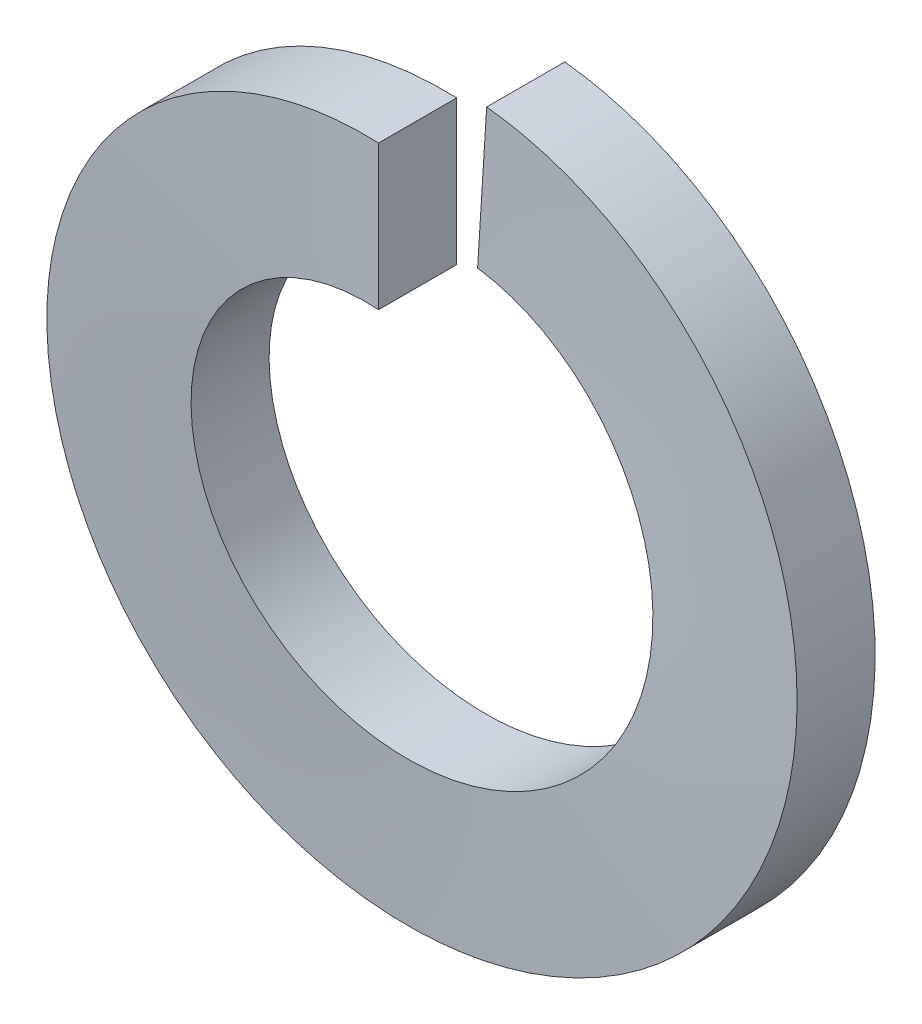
ISO-10303-21;
HEADER;
FILE_DESCRIPTION(('STEP AP214'),'2;1');
FILE_NAME('part.step','',(''),(''),'','','');
FILE_SCHEMA(('AUTOMOTIVE_DESIGN { 1 0 10303 214 1 1 1 1 }'));
ENDSEC;
DATA;
#1=APPLICATION_CONTEXT('core data for automotive mechanical design processes');
#2=APPLICATION_PROTOCOL_DEFINITION('international standard','automotive_design',2000,#1);
#3=PRODUCT_CONTEXT('',#1,'mechanical');
#4=PRODUCT('Part','Part','',(#3));
#5=PRODUCT_RELATED_PRODUCT_CATEGORY('part','',(#4));
#6=PRODUCT_DEFINITION_FORMATION('','',#4);
#7=PRODUCT_DEFINITION_CONTEXT('part definition',#1,'design');
#8=PRODUCT_DEFINITION('design','',#6,#7);
#9=PRODUCT_DEFINITION_SHAPE('','',#8);
#10=(LENGTH_UNIT() NAMED_UNIT(*) SI_UNIT(.MILLI.,.METRE.));
#11=(NAMED_UNIT(*) PLANE_ANGLE_UNIT() SI_UNIT($,.RADIAN.));
#12=(NAMED_UNIT(*) SI_UNIT($,.STERADIAN.) SOLID_ANGLE_UNIT());
#13=UNCERTAINTY_MEASURE_WITH_UNIT(LENGTH_MEASURE(1.E-05),#10,'distance_accuracy_value','');
#14=(GEOMETRIC_REPRESENTATION_CONTEXT(3) GLOBAL_UNCERTAINTY_ASSIGNED_CONTEXT((#13)) GLOBAL_UNIT_ASSIGNED_CONTEXT((#10,
#11,#12)) REPRESENTATION_CONTEXT('',''));
#15=CARTESIAN_POINT('',(0.,0.,0.));
#16=DIRECTION('',(0.,0.,1.));
#17=DIRECTION('',(1.,0.,0.));
#18=AXIS2_PLACEMENT_3D('',#15,#16,#17);
#19=CARTESIAN_POINT('',(0.,7.2,2.));
#20=DIRECTION('',(1.,0.,0.));
#21=DIRECTION('',(0.,0.,-1.));
#22=AXIS2_PLACEMENT_3D('',#19,#20,#21);
#23=PLANE('',#22);
#24=CARTESIAN_POINT('',(0.,9.05,2.));
#25=CARTESIAN_POINT('',(0.,5.35,2.));
#26=(BOUNDED_CURVE() B_SPLINE_CURVE(1,(#24,#25),.UNSPECIFIED.,.F.,
.F.) B_SPLINE_CURVE_WITH_KNOTS((2,2),(0.,1.),
.UNSPECIFIED.) CURVE() GEOMETRIC_REPRESENTATION_ITEM() RATIONAL_B_SPLINE_CURVE((1.,1.)) REPRESENTATION_ITEM(''));
#27=CARTESIAN_POINT('',(0.,9.05,2.));
#28=VERTEX_POINT('',#27);
#29=CARTESIAN_POINT('',(0.,5.35,2.));
#30=VERTEX_POINT('',#29);
#31=EDGE_CURVE('E54',#28,#30,#26,.T.);
#32=ORIENTED_EDGE('',*,*,#31,.T.);
#33=CARTESIAN_POINT('',(0.,5.35,2.));
#34=CARTESIAN_POINT('',(0.,5.35,0.));
#35=(BOUNDED_CURVE() B_SPLINE_CURVE(1,(#33,#34),.UNSPECIFIED.,.F.,
.F.) B_SPLINE_CURVE_WITH_KNOTS((2,2),(0.,1.),
.UNSPECIFIED.) CURVE() GEOMETRIC_REPRESENTATION_ITEM() RATIONAL_B_SPLINE_CURVE((1.,1.)) REPRESENTATION_ITEM(''));
#36=CARTESIAN_POINT('',(0.,5.35,0.));
#37=VERTEX_POINT('',#36);
#38=EDGE_CURVE('E86',#30,#37,#35,.T.);
#39=ORIENTED_EDGE('',*,*,#38,.T.);
#40=CARTESIAN_POINT('',(0.,5.35,0.));
#41=CARTESIAN_POINT('',(0.,9.05,0.));
#42=(BOUNDED_CURVE() B_SPLINE_CURVE(1,(#40,#41),.UNSPECIFIED.,.F.,
.F.) B_SPLINE_CURVE_WITH_KNOTS((2,2),(0.,1.),
.UNSPECIFIED.) CURVE() GEOMETRIC_REPRESENTATION_ITEM() RATIONAL_B_SPLINE_CURVE((1.,1.)) REPRESENTATION_ITEM(''));
#43=CARTESIAN_POINT('',(0.,9.05,0.));
#44=VERTEX_POINT('',#43);
#45=EDGE_CURVE('E89',#37,#44,#42,.T.);
#46=ORIENTED_EDGE('',*,*,#45,.T.);
#47=CARTESIAN_POINT('',(0.,9.05,0.));
#48=CARTESIAN_POINT('',(0.,9.05,2.));
#49=(BOUNDED_CURVE() B_SPLINE_CURVE(1,(#47,#48),.UNSPECIFIED.,.F.,
.F.) B_SPLINE_CURVE_WITH_KNOTS((2,2),(0.,1.),
.UNSPECIFIED.) CURVE() GEOMETRIC_REPRESENTATION_ITEM() RATIONAL_B_SPLINE_CURVE((1.,1.)) REPRESENTATION_ITEM(''));
#50=EDGE_CURVE('E69',#44,#28,#49,.T.);
#51=ORIENTED_EDGE('',*,*,#50,.T.);
#52=EDGE_LOOP('',(#32,#39,#46,#51));
#53=FACE_BOUND('',#52,.T.);
#54=ADVANCED_FACE('F43',(#53),#23,.T.);
#55=CARTESIAN_POINT('',(0.394024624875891,6.26261683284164,-0.200530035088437));
#56=DIRECTION('',(0.998026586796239,-0.0627927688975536,1.4900594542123E-05));
#57=DIRECTION('',(0.0627927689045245,0.998026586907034,0.));
#58=AXIS2_PLACEMENT_3D('',#55,#56,#57);
#59=PLANE('',#58);
#60=CARTESIAN_POINT('',(0.568274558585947,9.03214061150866,-0.200530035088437));
#61=CARTESIAN_POINT('',(0.335941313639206,5.33944223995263,-0.200530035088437));
#62=(BOUNDED_CURVE() B_SPLINE_CURVE(1,(#60,#61),.UNSPECIFIED.,.F.,
.F.) B_SPLINE_CURVE_WITH_KNOTS((2,2),(0.,1.),
.UNSPECIFIED.) CURVE() GEOMETRIC_REPRESENTATION_ITEM() RATIONAL_B_SPLINE_CURVE((0.991096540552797,0.991096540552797)) REPRESENTATION_ITEM(''));
#63=CARTESIAN_POINT('',(0.335952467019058,5.33944153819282,-0.200529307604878));
#64=VERTEX_POINT('',#63);
#65=CARTESIAN_POINT('',(0.568274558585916,9.03214061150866,-0.200530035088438));
#66=VERTEX_POINT('',#65);
#67=EDGE_CURVE('E12',#64,#66,#62,.F.);
#68=ORIENTED_EDGE('',*,*,#67,.T.);
#69=CARTESIAN_POINT('',(0.568274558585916,9.03214061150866,-2.20053003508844));
#70=CARTESIAN_POINT('',(0.568274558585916,9.03214061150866,-0.200530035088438));
#71=(BOUNDED_CURVE() B_SPLINE_CURVE(1,(#69,#70),.UNSPECIFIED.,.F.,
.F.) B_SPLINE_CURVE_WITH_KNOTS((2,2),(0.,1.),
.UNSPECIFIED.) CURVE() GEOMETRIC_REPRESENTATION_ITEM() RATIONAL_B_SPLINE_CURVE((0.991096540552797,0.991096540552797)) REPRESENTATION_ITEM(''));
#72=CARTESIAN_POINT('',(0.56829342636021,9.03213942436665,-2.20052930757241));
#73=VERTEX_POINT('',#72);
#74=EDGE_CURVE('E131',#66,#73,#71,.F.);
#75=ORIENTED_EDGE('',*,*,#74,.T.);
#76=CARTESIAN_POINT('',(0.335963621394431,5.33944083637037,-2.20052858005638));
#77=CARTESIAN_POINT('',(0.568312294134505,9.03213823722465,-2.20052858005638));
#78=(BOUNDED_CURVE() B_SPLINE_CURVE(1,(#76,#77),.UNSPECIFIED.,.F.,
.F.) B_SPLINE_CURVE_WITH_KNOTS((2,2),(0.,1.),
.UNSPECIFIED.) CURVE() GEOMETRIC_REPRESENTATION_ITEM() RATIONAL_B_SPLINE_CURVE((0.991096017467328,0.991096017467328)) REPRESENTATION_ITEM(''));
#79=CARTESIAN_POINT('',(0.33596362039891,5.33944083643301,-2.20052858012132));
#80=VERTEX_POINT('',#79);
#81=EDGE_CURVE('E109',#73,#80,#78,.F.);
#82=ORIENTED_EDGE('',*,*,#81,.T.);
#83=CARTESIAN_POINT('',(0.33596362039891,5.33944083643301,-0.200528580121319));
#84=CARTESIAN_POINT('',(0.33596362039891,5.33944083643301,-2.20052858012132));
#85=(BOUNDED_CURVE() B_SPLINE_CURVE(1,(#83,#84),.UNSPECIFIED.,.F.,
.F.) B_SPLINE_CURVE_WITH_KNOTS((2,2),(0.,1.),
.UNSPECIFIED.) CURVE() GEOMETRIC_REPRESENTATION_ITEM() RATIONAL_B_SPLINE_CURVE((0.991096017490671,0.991096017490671)) REPRESENTATION_ITEM(''));
#86=EDGE_CURVE('E94',#80,#64,#85,.F.);
#87=ORIENTED_EDGE('',*,*,#86,.T.);
#88=EDGE_LOOP('',(#68,#75,#82,#87));
#89=FACE_BOUND('',#88,.T.);
#90=ADVANCED_FACE('F45',(#89),#59,.F.);
#91=CARTESIAN_POINT('',(0.,9.05,2.));
#92=CARTESIAN_POINT('',(-2.9405232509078,9.05,1.88888888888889));
#93=CARTESIAN_POINT('',(-5.31945653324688,7.32160379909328,1.77777777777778));
#94=CARTESIAN_POINT('',(-7.69838981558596,5.59320759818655,1.66666666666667));
#95=CARTESIAN_POINT('',(-8.60706147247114,2.79660379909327,1.55555555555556));
#96=CARTESIAN_POINT('',(-9.51573312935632,0.,1.44444444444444));
#97=CARTESIAN_POINT('',(-8.60706147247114,-2.79660379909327,1.33333333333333));
#98=CARTESIAN_POINT('',(-7.69838981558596,-5.59320759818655,1.22222222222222));
#99=CARTESIAN_POINT('',(-5.31945653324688,-7.32160379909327,1.11111111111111));
#100=CARTESIAN_POINT('',(-2.9405232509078,-9.05,1.));
#101=CARTESIAN_POINT('',(0.,-9.05,0.888888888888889));
#102=CARTESIAN_POINT('',(2.9405232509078,-9.05,0.777777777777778));
#103=CARTESIAN_POINT('',(5.31945653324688,-7.32160379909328,0.666666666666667));
#104=CARTESIAN_POINT('',(7.69838981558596,-5.59320759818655,0.555555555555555));
#105=CARTESIAN_POINT('',(8.60706147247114,-2.79660379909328,0.444444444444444));
#106=CARTESIAN_POINT('',(9.51573312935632,0.,0.333333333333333));
#107=CARTESIAN_POINT('',(8.60706147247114,2.79660379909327,0.222222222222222));
#108=CARTESIAN_POINT('',(7.69838981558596,5.59320759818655,0.111111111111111));
#109=CARTESIAN_POINT('',(5.31945653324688,7.32160379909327,0.));
#110=CARTESIAN_POINT('',(3.19234294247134,8.8670422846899,-0.0993495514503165));
#111=CARTESIAN_POINT('',(0.568274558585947,9.03214061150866,-0.200530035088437));
#112=CARTESIAN_POINT('',(0.,5.35,2.));
#113=CARTESIAN_POINT('',(-1.73832037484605,5.35,1.88888888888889));
#114=CARTESIAN_POINT('',(-3.14465109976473,4.32824091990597,1.77777777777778));
#115=CARTESIAN_POINT('',(-4.55098182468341,3.30648183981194,1.66666666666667));
#116=CARTESIAN_POINT('',(-5.08815236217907,1.65324091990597,1.55555555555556));
#117=CARTESIAN_POINT('',(-5.62532289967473,0.,1.44444444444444));
#118=CARTESIAN_POINT('',(-5.08815236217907,-1.65324091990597,1.33333333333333));
#119=CARTESIAN_POINT('',(-4.55098182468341,-3.30648183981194,1.22222222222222));
#120=CARTESIAN_POINT('',(-3.14465109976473,-4.32824091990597,1.11111111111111));
#121=CARTESIAN_POINT('',(-1.73832037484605,-5.35,1.));
#122=CARTESIAN_POINT('',(0.,-5.35,0.888888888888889));
#123=CARTESIAN_POINT('',(1.73832037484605,-5.35,0.777777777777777));
#124=CARTESIAN_POINT('',(3.14465109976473,-4.32824091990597,0.666666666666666));
#125=CARTESIAN_POINT('',(4.55098182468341,-3.30648183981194,0.555555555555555));
#126=CARTESIAN_POINT('',(5.08815236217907,-1.65324091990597,0.444444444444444));
#127=CARTESIAN_POINT('',(5.62532289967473,0.,0.333333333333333));
#128=CARTESIAN_POINT('',(5.08815236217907,1.65324091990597,0.222222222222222));
#129=CARTESIAN_POINT('',(4.55098182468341,3.30648183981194,0.111111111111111));
#130=CARTESIAN_POINT('',(3.14465109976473,4.32824091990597,0.));
#131=CARTESIAN_POINT('',(1.88718615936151,5.24184267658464,-0.0993495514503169));
#132=CARTESIAN_POINT('',(0.335941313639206,5.33944223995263,-0.200530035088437));
#133=(BOUNDED_SURFACE() B_SPLINE_SURFACE(1,2,((#91,#92,#93,#94,#95,#96,#97,#98,#99,#100,#101,
#102,#103,#104,#105,#106,#107,#108,#109,#110,#111),(#112,#113,#114,#115,#116,#117,#118,#119,
#120,#121,#122,#123,#124,#125,#126,#127,#128,#129,#130,#131,#132)),.UNSPECIFIED.,.F.,.F.,
.F.) B_SPLINE_SURFACE_WITH_KNOTS((2,2),(3,2,2,2,2,2,2,2,2,2,3),(0.,1.),(0.,0.1,0.2,0.3,0.4,0.5,
0.6,0.7,0.8,0.9,0.989880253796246),
.UNSPECIFIED.) GEOMETRIC_REPRESENTATION_ITEM() RATIONAL_B_SPLINE_SURFACE(((1.,0.951056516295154,
1.,0.951056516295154,1.,0.951056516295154,1.,0.951056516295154,1.,0.951056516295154,1.,
0.951056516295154,1.,0.951056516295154,1.,0.951056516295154,1.,0.951056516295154,1.,
0.95600947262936,0.991096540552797),(1.,0.951056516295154,1.,0.951056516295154,1.,
0.951056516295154,1.,0.951056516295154,1.,0.951056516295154,1.,0.951056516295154,1.,
0.951056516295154,1.,0.951056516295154,1.,0.951056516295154,1.,0.95600947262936,0.991096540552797))) REPRESENTATION_ITEM('') SURFACE());
#134=CARTESIAN_POINT('',(0.,9.05,2.));
#135=CARTESIAN_POINT('',(-2.9405232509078,9.05,1.88888888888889));
#136=CARTESIAN_POINT('',(-5.31945653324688,7.32160379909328,1.77777777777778));
#137=CARTESIAN_POINT('',(-7.69838981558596,5.59320759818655,1.66666666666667));
#138=CARTESIAN_POINT('',(-8.60706147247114,2.79660379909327,1.55555555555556));
#139=CARTESIAN_POINT('',(-9.51573312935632,0.,1.44444444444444));
#140=CARTESIAN_POINT('',(-8.60706147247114,-2.79660379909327,1.33333333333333));
#141=CARTESIAN_POINT('',(-7.69838981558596,-5.59320759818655,1.22222222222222));
#142=CARTESIAN_POINT('',(-5.31945653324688,-7.32160379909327,1.11111111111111));
#143=CARTESIAN_POINT('',(-2.9405232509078,-9.05,1.));
#144=CARTESIAN_POINT('',(0.,-9.05,0.888888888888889));
#145=CARTESIAN_POINT('',(2.9405232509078,-9.05,0.777777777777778));
#146=CARTESIAN_POINT('',(5.31945653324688,-7.32160379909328,0.666666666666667));
#147=CARTESIAN_POINT('',(7.69838981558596,-5.59320759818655,0.555555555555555));
#148=CARTESIAN_POINT('',(8.60706147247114,-2.79660379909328,0.444444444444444));
#149=CARTESIAN_POINT('',(9.51573312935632,0.,0.333333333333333));
#150=CARTESIAN_POINT('',(8.60706147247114,2.79660379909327,0.222222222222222));
#151=CARTESIAN_POINT('',(7.69838981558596,5.59320759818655,0.111111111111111));
#152=CARTESIAN_POINT('',(5.31945653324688,7.32160379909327,0.));
#153=CARTESIAN_POINT('',(3.19234294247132,8.86704228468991,-0.0993495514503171));
#154=CARTESIAN_POINT('',(0.568274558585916,9.03214061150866,-0.200530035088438));
#155=(BOUNDED_CURVE() B_SPLINE_CURVE(2,(#134,#135,#136,#137,#138,#139,#140,#141,#142,#143,#144,
#145,#146,#147,#148,#149,#150,#151,#152,#153,#154),.UNSPECIFIED.,.F.,
.F.) B_SPLINE_CURVE_WITH_KNOTS((3,2,2,2,2,2,2,2,2,2,3),(0.,0.1,0.2,0.3,0.4,0.5,0.6,0.7,0.8,0.9,
0.989880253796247),
.UNSPECIFIED.) CURVE() GEOMETRIC_REPRESENTATION_ITEM() RATIONAL_B_SPLINE_CURVE((1.,
0.951056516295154,1.,0.951056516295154,1.,0.951056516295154,1.,0.951056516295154,1.,
0.951056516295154,1.,0.951056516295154,1.,0.951056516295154,1.,0.951056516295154,1.,
0.951056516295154,1.,0.956009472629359,0.991096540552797)) REPRESENTATION_ITEM(''));
#156=EDGE_CURVE('E61',#28,#66,#155,.T.);
#157=CARTESIAN_POINT('',(0.,5.35,2.));
#158=CARTESIAN_POINT('',(-0.0621552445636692,5.35000046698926,1.99602712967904));
#159=CARTESIAN_POINT('',(-0.124309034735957,5.34891685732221,1.99203183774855));
#160=CARTESIAN_POINT('',(-0.248846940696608,5.3445743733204,1.98398135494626));
#161=CARTESIAN_POINT('',(-0.311230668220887,5.34130472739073,1.97992596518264));
#162=CARTESIAN_POINT('',(-0.436114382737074,5.33256408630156,1.97176203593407));
#163=CARTESIAN_POINT('',(-0.498613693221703,5.3270835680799,1.96765334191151));
#164=CARTESIAN_POINT('',(-0.623612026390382,5.31390367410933,1.95938989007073));
#165=CARTESIAN_POINT('',(-0.68611017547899,5.30619608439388,1.95523501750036));
#166=CARTESIAN_POINT('',(-0.810987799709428,5.28855250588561,1.94688657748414));
#167=CARTESIAN_POINT('',(-0.873366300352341,5.27860965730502,1.94269292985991));
#168=CARTESIAN_POINT('',(-0.997885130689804,5.25649442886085,1.93427455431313));
#169=CARTESIAN_POINT('',(-1.06002448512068,5.24431657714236,1.93004977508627));
#170=CARTESIAN_POINT('',(-1.18394515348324,5.21773868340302,1.92157695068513));
#171=CARTESIAN_POINT('',(-1.24572559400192,5.20333457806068,1.91732887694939));
#172=CARTESIAN_POINT('',(-1.36880894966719,5.17232005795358,1.90881743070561));
#173=CARTESIAN_POINT('',(-1.43011119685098,5.1557069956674,1.90455404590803));
#174=CARTESIAN_POINT('',(-1.55211982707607,5.12029894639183,1.89602004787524));
#175=CARTESIAN_POINT('',(-1.61282585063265,5.10150272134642,1.89174943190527));
#176=CARTESIAN_POINT('',(-1.73352559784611,5.06176112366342,1.88320909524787));
#177=CARTESIAN_POINT('',(-1.79351937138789,5.04081590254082,1.87893937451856));
#178=CARTESIAN_POINT('',(-1.91268082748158,4.99681728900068,1.87040895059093));
#179=CARTESIAN_POINT('',(-1.97184906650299,4.973765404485,1.86614824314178));
#180=CARTESIAN_POINT('',(-2.08924902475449,4.92560236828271,1.8576439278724));
#181=CARTESIAN_POINT('',(-2.14748189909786,4.90049403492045,1.85340030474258));
#182=CARTESIAN_POINT('',(-2.26290474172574,4.84827458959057,1.84493810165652));
#183=CARTESIAN_POINT('',(-2.32009654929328,4.82116754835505,1.84071948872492));
#184=CARTESIAN_POINT('',(-2.43333556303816,4.76501433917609,1.83231523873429));
#185=CARTESIAN_POINT('',(-2.48938537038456,4.73597342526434,1.82812954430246));
#186=CARTESIAN_POINT('',(-2.60024393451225,4.67602283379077,1.81979834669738));
#187=CARTESIAN_POINT('',(-2.65505612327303,4.64511951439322,1.81565275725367));
#188=CARTESIAN_POINT('',(-2.76334890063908,4.58152055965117,1.80741067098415));
#189=CARTESIAN_POINT('',(-2.8168338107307,4.54883229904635,1.80331404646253));
#190=CARTESIAN_POINT('',(-2.92238739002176,4.48174576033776,1.79517134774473));
#191=CARTESIAN_POINT('',(-2.97446132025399,4.44735577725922,1.79112512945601));
#192=CARTESIAN_POINT('',(-3.07713004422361,4.37694261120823,1.78310984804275));
#193=CARTESIAN_POINT('',(-3.1277307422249,4.34092806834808,1.77914050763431));
#194=CARTESIAN_POINT('',(-3.22774837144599,4.26708478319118,1.77116541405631));
#195=CARTESIAN_POINT('',(-3.27716266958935,4.22925248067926,1.76715960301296));
#196=CARTESIAN_POINT('',(-3.37487474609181,4.1517020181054,1.75908540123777));
#197=CARTESIAN_POINT('',(-3.42316597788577,4.11197563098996,1.75501680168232));
#198=CARTESIAN_POINT('',(-3.51852542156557,4.03068490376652,1.74682910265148));
#199=CARTESIAN_POINT('',(-3.56558761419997,3.98911351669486,1.74270986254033));
#200=CARTESIAN_POINT('',(-3.65838490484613,3.90418877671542,1.73442661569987));
#201=CARTESIAN_POINT('',(-3.70411461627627,3.86082954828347,1.7302625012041));
#202=CARTESIAN_POINT('',(-3.79414642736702,3.77239266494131,1.72189731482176));
#203=CARTESIAN_POINT('',(-3.83844387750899,3.72731028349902,1.71769616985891));
#204=CARTESIAN_POINT('',(-3.92551478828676,3.63549800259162,1.70926448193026));
#205=CARTESIAN_POINT('',(-3.96828443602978,3.58876449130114,1.70503389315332));
#206=CARTESIAN_POINT('',(-4.05220820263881,3.49372785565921,1.69655119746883));
#207=CARTESIAN_POINT('',(-4.0933594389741,3.44542218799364,1.69229906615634));
#208=CARTESIAN_POINT('',(-4.17396030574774,3.34732572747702,1.68378127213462));
#209=CARTESIAN_POINT('',(-4.21340807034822,3.29753340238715,1.67951559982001));
#210=CARTESIAN_POINT('',(-4.29052196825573,3.1965542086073,1.67097881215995));
#211=CARTESIAN_POINT('',(-4.32818733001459,3.14536675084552,1.66670769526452));
#212=CARTESIAN_POINT('',(-4.4016629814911,3.04169341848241,1.65816814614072));
#213=CARTESIAN_POINT('',(-4.43747366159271,2.98920782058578,1.65389971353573));
#214=CARTESIAN_POINT('',(-4.50717356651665,2.88303927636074,1.64537364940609));
#215=CARTESIAN_POINT('',(-4.54106440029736,2.82935738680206,1.64111601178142));
#216=CARTESIAN_POINT('',(-4.606865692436,2.72090161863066,1.632619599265));
#217=CARTESIAN_POINT('',(-4.6387790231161,2.66612948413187,1.62838080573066));
#218=CARTESIAN_POINT('',(-4.7005741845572,2.555602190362,1.61993000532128));
#219=CARTESIAN_POINT('',(-4.73046018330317,2.49984936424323,1.61571796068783));
#220=CARTESIAN_POINT('',(-4.78815761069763,2.38747253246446,1.60732851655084));
#221=CARTESIAN_POINT('',(-4.81597452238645,2.33085134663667,1.60315105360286));
#222=CARTESIAN_POINT('',(-4.86949893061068,2.21685181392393,1.59483806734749));
#223=CARTESIAN_POINT('',(-4.8952132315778,2.15947666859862,1.59070245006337));
#224=CARTESIAN_POINT('',(-4.94450592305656,2.04408456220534,1.58248151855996));
#225=CARTESIAN_POINT('',(-4.96809243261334,1.9860710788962,1.57839606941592));
#226=CARTESIAN_POINT('',(-5.01311131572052,1.8695186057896,1.57027864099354));
#227=CARTESIAN_POINT('',(-5.03455310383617,1.81098326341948,1.56624650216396));
#228=CARTESIAN_POINT('',(-5.07529472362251,1.69343922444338,1.55825242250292));
#229=CARTESIAN_POINT('',(-5.09460304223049,1.6344334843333,1.55429026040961));
#230=CARTESIAN_POINT('',(-5.13121865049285,1.51557774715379,1.54630476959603));
#231=CARTESIAN_POINT('',(-5.14851858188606,1.45572549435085,1.54228127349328));
#232=CARTESIAN_POINT('',(-5.18109344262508,1.33517319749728,1.53417849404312));
#233=CARTESIAN_POINT('',(-5.19635847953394,1.27447049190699,1.53009903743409));
#234=CARTESIAN_POINT('',(-5.22480687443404,1.1523201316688,1.52188973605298));
#235=CARTESIAN_POINT('',(-5.23798147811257,1.09087044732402,1.5177597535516));
#236=CARTESIAN_POINT('',(-5.2621993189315,0.967333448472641,1.50945702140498));
#237=CARTESIAN_POINT('',(-5.27323501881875,0.905244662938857,1.505284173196));
#238=CARTESIAN_POINT('',(-5.29313272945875,0.780540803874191,1.49690308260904));
#239=CARTESIAN_POINT('',(-5.30198848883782,0.71792473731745,1.4926947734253));
#240=CARTESIAN_POINT('',(-5.31749176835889,0.592281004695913,1.48425049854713));
#241=CARTESIAN_POINT('',(-5.32413438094,0.529252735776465,1.48001449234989));
#242=CARTESIAN_POINT('',(-5.33518490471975,0.402901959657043,1.47152270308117));
#243=CARTESIAN_POINT('',(-5.33958929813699,0.339579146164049,1.46726689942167));
#244=CARTESIAN_POINT('',(-5.34614525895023,0.212758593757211,1.45874353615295));
#245=CARTESIAN_POINT('',(-5.34829473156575,0.149260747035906,1.4544759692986));
#246=CARTESIAN_POINT('',(-5.35033123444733,0.022210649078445,1.44593717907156));
#247=CARTESIAN_POINT('',(-5.35021761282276,-0.0413416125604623,1.44166595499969));
#248=CARTESIAN_POINT('',(-5.34772691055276,-0.168379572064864,1.43312798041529));
#249=CARTESIAN_POINT('',(-5.34535062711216,-0.231865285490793,1.42886122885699));
#250=CARTESIAN_POINT('',(-5.33834219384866,-0.358649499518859,1.42034030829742));
#251=CARTESIAN_POINT('',(-5.33371228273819,-0.421948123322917,1.41608613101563));
#252=CARTESIAN_POINT('',(-5.32221272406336,-0.548238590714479,1.4075983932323));
#253=CARTESIAN_POINT('',(-5.31534673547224,-0.611230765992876,1.4033648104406));
#254=CARTESIAN_POINT('',(-5.2993995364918,-0.736790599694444,1.39492618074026));
#255=CARTESIAN_POINT('',(-5.29032337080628,-0.799358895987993,1.39072109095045));
#256=CARTESIAN_POINT('',(-5.26998848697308,-0.923955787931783,1.38234716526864));
#257=CARTESIAN_POINT('',(-5.25873615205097,-0.985985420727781,1.37817825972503));
#258=CARTESIAN_POINT('',(-5.23408944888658,-1.10939305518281,1.36988431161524));
#259=CARTESIAN_POINT('',(-5.22070274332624,-1.17077258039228,1.36575916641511));
#260=CARTESIAN_POINT('',(-5.1918352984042,-1.29277193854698,1.35755968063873));
#261=CARTESIAN_POINT('',(-5.17636343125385,-1.35339386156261,1.35348520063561));
#262=CARTESIAN_POINT('',(-5.14338069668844,-1.47377454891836,1.3453951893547));
#263=CARTESIAN_POINT('',(-5.1258798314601,-1.53353604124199,1.3413794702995));
#264=CARTESIAN_POINT('',(-5.08885606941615,-1.65224023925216,1.33339958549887));
#265=CARTESIAN_POINT('',(-5.06933923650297,-1.71118482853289,1.32943530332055));
#266=CARTESIAN_POINT('',(-5.0281741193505,-1.82862083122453,1.32143242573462));
#267=CARTESIAN_POINT('',(-5.00651658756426,-1.88710898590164,1.31739357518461));
#268=CARTESIAN_POINT('',(-4.96106738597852,-2.00355545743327,1.30926435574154));
#269=CARTESIAN_POINT('',(-4.93726643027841,-2.06151013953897,1.30517383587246));
#270=CARTESIAN_POINT('',(-4.88754687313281,-2.17677295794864,1.29694322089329));
#271=CARTESIAN_POINT('',(-4.86162028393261,-2.23407763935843,1.29280299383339));
#272=CARTESIAN_POINT('',(-4.80767415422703,-2.34792466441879,1.28448159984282));
#273=CARTESIAN_POINT('',(-4.77964794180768,-2.40446384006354,1.28030034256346));
#274=CARTESIAN_POINT('',(-4.72153560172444,-2.51666522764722,1.27190405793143));
#275=CARTESIAN_POINT('',(-4.69144412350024,-2.57232466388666,1.26768896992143));
#276=CARTESIAN_POINT('',(-4.62924251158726,-2.68265399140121,1.25923287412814));
#277=CARTESIAN_POINT('',(-4.597128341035,-2.73732160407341,1.25499183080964));
#278=CARTESIAN_POINT('',(-4.53093067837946,-2.84555745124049,1.24649171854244));
#279=CARTESIAN_POINT('',(-4.49684444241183,-2.89912400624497,1.24223263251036));
#280=CARTESIAN_POINT('',(-4.42675981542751,-3.00505138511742,1.23370448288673));
#281=CARTESIAN_POINT('',(-4.39075993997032,-3.05741122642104,1.22943541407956));
#282=CARTESIAN_POINT('',(-4.31691271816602,-3.1608229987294,1.22089540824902));
#283=CARTESIAN_POINT('',(-4.2790651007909,-3.21187473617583,1.21662447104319));
#284=CARTESIAN_POINT('',(-4.20159420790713,-3.31257295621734,1.20808885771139));
#285=CARTESIAN_POINT('',(-4.1619718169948,-3.36222011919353,1.20382417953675));
#286=CARTESIAN_POINT('',(-4.08102986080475,-3.46001729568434,1.19530918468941));
#287=CARTESIAN_POINT('',(-4.03971226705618,-3.50816894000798,1.19105885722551));
#288=CARTESIAN_POINT('',(-3.95546454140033,-3.60288919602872,1.18258056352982));
#289=CARTESIAN_POINT('',(-3.91253738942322,-3.64946045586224,1.17835257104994));
#290=CARTESIAN_POINT('',(-3.8251607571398,-3.74094057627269,1.16992687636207));
#291=CARTESIAN_POINT('',(-3.78071517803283,-3.78585315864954,1.16572912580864));
#292=CARTESIAN_POINT('',(-3.69039686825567,-3.87394349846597,1.15737142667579));
#293=CARTESIAN_POINT('',(-3.64452886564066,-3.91712609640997,1.15321140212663));
#294=CARTESIAN_POINT('',(-3.55146513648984,-4.00169138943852,1.14493731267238));
#295=CARTESIAN_POINT('',(-3.5042748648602,-4.04308007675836,1.14082313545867));
#296=CARTESIAN_POINT('',(-3.40866979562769,-4.12399995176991,1.13264538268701));
#297=CARTESIAN_POINT('',(-3.36026107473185,-4.16353830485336,1.1285816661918));
#298=CARTESIAN_POINT('',(-3.26232459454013,-4.24070818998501,1.12052120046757));
#299=CARTESIAN_POINT('',(-3.21280342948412,-4.27834806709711,1.11652422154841));
#300=CARTESIAN_POINT('',(-3.11253697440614,-4.35183552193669,1.10855156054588));
#301=CARTESIAN_POINT('',(-3.06179319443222,-4.3876851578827,1.1045758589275));
#302=CARTESIAN_POINT('',(-2.95883635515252,-4.45776677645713,1.09654857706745));
#303=CARTESIAN_POINT('',(-2.90661725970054,-4.49198985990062,1.09249671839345));
#304=CARTESIAN_POINT('',(-2.80078133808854,-4.55873394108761,1.08434321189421));
#305=CARTESIAN_POINT('',(-2.74715934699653,-4.59124673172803,1.08024142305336));
#306=CARTESIAN_POINT('',(-2.63860104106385,-4.65448661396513,1.07198978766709));
#307=CARTESIAN_POINT('',(-2.58366049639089,-4.68520642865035,1.06783981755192));
#308=CARTESIAN_POINT('',(-2.47255447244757,-4.74478244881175,1.05950059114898));
#309=CARTESIAN_POINT('',(-2.41638564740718,-4.77363240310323,1.05531125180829));
#310=CARTESIAN_POINT('',(-2.30291841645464,-4.82939676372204,1.04690048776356));
#311=CARTESIAN_POINT('',(-2.24561748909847,-4.85630603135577,1.04267900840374));
#312=CARTESIAN_POINT('',(-2.12998673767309,-4.90812368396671,1.03421186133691));
#313=CARTESIAN_POINT('',(-2.07165514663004,-4.93302812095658,1.02996616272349));
#314=CARTESIAN_POINT('',(-1.95406853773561,-4.98077784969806,1.02145850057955));
#315=CARTESIAN_POINT('',(-1.8948124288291,-5.00362045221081,1.01719652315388));
#316=CARTESIAN_POINT('',(-1.77548640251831,-5.0471957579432,1.00866437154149));
#317=CARTESIAN_POINT('',(-1.71541598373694,-5.06792708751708,1.00439419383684));
#318=CARTESIAN_POINT('',(-1.5945744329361,-5.10723696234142,0.995853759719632));
#319=CARTESIAN_POINT('',(-1.53380329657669,-5.12581549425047,0.991583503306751));
#320=CARTESIAN_POINT('',(-1.41167617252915,-5.16078504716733,0.983051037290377));
#321=CARTESIAN_POINT('',(-1.35032057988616,-5.17717744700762,0.978788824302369));
#322=CARTESIAN_POINT('',(-1.22714243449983,-5.20774837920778,0.97028053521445));
#323=CARTESIAN_POINT('',(-1.16532057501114,-5.22192970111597,0.966034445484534));
#324=CARTESIAN_POINT('',(-1.04132906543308,-5.24806062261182,0.957566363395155));
#325=CARTESIAN_POINT('',(-0.979160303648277,-5.26001442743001,0.953344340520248));
#326=CARTESIAN_POINT('',(-0.854594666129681,-5.28168101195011,0.944932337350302));
#327=CARTESIAN_POINT('',(-0.79219877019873,-5.29139940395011,0.94074230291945));
#328=CARTESIAN_POINT('',(-0.667298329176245,-5.30859438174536,0.932401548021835));
#329=CARTESIAN_POINT('',(-0.604794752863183,-5.31607796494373,0.928250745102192));
#330=CARTESIAN_POINT('',(-0.479797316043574,-5.32881095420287,0.919997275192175));
#331=CARTESIAN_POINT('',(-0.417304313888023,-5.3340687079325,0.915894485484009));
#332=CARTESIAN_POINT('',(-0.292445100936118,-5.34236589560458,0.907738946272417));
#333=CARTESIAN_POINT('',(-0.230079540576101,-5.34541498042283,0.903686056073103));
#334=CARTESIAN_POINT('',(-0.105584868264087,-5.34931874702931,0.895656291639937));
#335=CARTESIAN_POINT('',(-0.0434561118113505,-5.35018420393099,0.891679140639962));
#336=CARTESIAN_POINT('',(0.0808550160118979,-5.34975043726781,0.883706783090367));
#337=CARTESIAN_POINT('',(0.143037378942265,-5.34844905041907,0.8797115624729));
#338=CARTESIAN_POINT('',(0.2676205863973,-5.34366767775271,0.871653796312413));
#339=CARTESIAN_POINT('',(0.330021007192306,-5.34017704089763,0.867591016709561));
#340=CARTESIAN_POINT('',(0.454926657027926,-5.33099239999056,0.859415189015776));
#341=CARTESIAN_POINT('',(0.517431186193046,-5.32528900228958,0.855302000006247));
#342=CARTESIAN_POINT('',(0.642428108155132,-5.31166199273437,0.847029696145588));
#343=CARTESIAN_POINT('',(0.704919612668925,-5.30373030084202,0.842870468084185));
#344=CARTESIAN_POINT('',(0.8297720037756,-5.28563803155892,0.834514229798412));
#345=CARTESIAN_POINT('',(0.892131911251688,-5.2754707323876,0.830317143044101));
#346=CARTESIAN_POINT('',(1.01660152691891,-5.25290695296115,0.821892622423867));
#347=CARTESIAN_POINT('',(1.07871026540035,-5.24050514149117,0.817665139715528));
#348=CARTESIAN_POINT('',(1.20255768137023,-5.21348053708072,0.809187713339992));
#349=CARTESIAN_POINT('',(1.26429550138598,-5.19885382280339,0.804937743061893));
#350=CARTESIAN_POINT('',(1.38728167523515,-5.16739614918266,0.796423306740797));
#351=CARTESIAN_POINT('',(1.44852938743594,-5.15056268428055,0.792158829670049));
#352=CARTESIAN_POINT('',(1.57041716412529,-5.1147167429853,0.783623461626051));
#353=CARTESIAN_POINT('',(1.6310569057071,-5.09570316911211,0.779352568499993));
#354=CARTESIAN_POINT('',(1.75161253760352,-5.05553061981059,0.770812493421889));
#355=CARTESIAN_POINT('',(1.81152852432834,-5.03437193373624,0.766543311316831));
#356=CARTESIAN_POINT('',(1.93052316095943,-4.9899509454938,0.758014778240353));
#357=CARTESIAN_POINT('',(1.98960242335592,-4.96669028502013,0.753755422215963));
#358=CARTESIAN_POINT('',(2.10681355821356,-4.91811502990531,0.745254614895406));
#359=CARTESIAN_POINT('',(2.16494665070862,-4.89280338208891,0.741013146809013));
#360=CARTESIAN_POINT('',(2.28015950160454,-4.84018338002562,0.732556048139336));
#361=CARTESIAN_POINT('',(2.33724117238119,-4.81287921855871,0.728340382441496));
#362=CARTESIAN_POINT('',(2.45024998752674,-4.75633853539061,0.719942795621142));
#363=CARTESIAN_POINT('',(2.50617981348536,-4.72710738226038,0.715760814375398));
#364=CARTESIAN_POINT('',(2.6167890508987,-4.6667837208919,0.707437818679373));
#365=CARTESIAN_POINT('',(2.67147198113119,-4.63569767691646,0.703296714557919));
#366=CARTESIAN_POINT('',(2.77949748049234,-4.57174127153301,0.695064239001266));
#367=CARTESIAN_POINT('',(2.83284446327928,-4.53887838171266,0.690972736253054));
#368=CARTESIAN_POINT('',(2.93811410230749,-4.47145109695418,0.682841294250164));
#369=CARTESIAN_POINT('',(2.99004211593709,-4.43689508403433,0.678801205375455));
#370=CARTESIAN_POINT('',(3.09242684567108,-4.36614822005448,0.670796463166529));
#371=CARTESIAN_POINT('',(3.14288919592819,-4.32996555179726,0.666831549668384));
#372=CARTESIAN_POINT('',(3.24266153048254,-4.25576341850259,0.658852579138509));
#373=CARTESIAN_POINT('',(3.29196789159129,-4.21773909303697,0.65483841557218));
#374=CARTESIAN_POINT('',(3.38945341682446,-4.13980895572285,0.646750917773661));
#375=CARTESIAN_POINT('',(3.43762608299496,-4.09989503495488,0.6426773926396));
#376=CARTESIAN_POINT('',(3.53273778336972,-4.01823453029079,0.63447980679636));
#377=CARTESIAN_POINT('',(3.5796708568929,-3.9764810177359,0.630355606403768));
#378=CARTESIAN_POINT('',(3.67219966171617,-3.89119805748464,0.622063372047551));
#379=CARTESIAN_POINT('',(3.71779007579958,-3.84766285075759,0.617895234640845));
#380=CARTESIAN_POINT('',(3.8075334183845,-3.75888080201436,0.609522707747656));
#381=CARTESIAN_POINT('',(3.85168177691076,-3.71362934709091,0.605318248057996));
#382=CARTESIAN_POINT('',(3.93844508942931,-3.62148642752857,0.596880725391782));
#383=CARTESIAN_POINT('',(3.98105631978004,-3.57459146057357,0.592647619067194));
#384=CARTESIAN_POINT('',(4.06465435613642,-3.47924010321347,0.584160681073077));
#385=CARTESIAN_POINT('',(4.10563837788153,-3.43078127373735,0.579906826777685));
#386=CARTESIAN_POINT('',(4.18589650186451,-3.33238731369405,0.571386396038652));
#387=CARTESIAN_POINT('',(4.22516884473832,-3.28245074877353,0.567119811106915));
#388=CARTESIAN_POINT('',(4.301924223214,-3.18119248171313,0.558582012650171));
#389=CARTESIAN_POINT('',(4.339406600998,-3.12987028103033,0.55431079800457));
#390=CARTESIAN_POINT('',(4.41250929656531,-3.02593739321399,0.545771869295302));
#391=CARTESIAN_POINT('',(4.44813012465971,-2.97332706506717,0.541504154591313));
#392=CARTESIAN_POINT('',(4.51744406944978,-2.86691945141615,0.532980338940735));
#393=CARTESIAN_POINT('',(4.55113892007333,-2.81312329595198,0.528724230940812));
#394=CARTESIAN_POINT('',(4.61654275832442,-2.70444978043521,0.520231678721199));
#395=CARTESIAN_POINT('',(4.64825474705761,-2.64957422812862,0.515995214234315));
#396=CARTESIAN_POINT('',(4.70964253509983,-2.53885120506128,0.50754986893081));
#397=CARTESIAN_POINT('',(4.73932263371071,-2.48300612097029,0.503340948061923));
#398=CARTESIAN_POINT('',(4.79660438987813,-2.37045613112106,0.494958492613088));
#399=CARTESIAN_POINT('',(4.8242116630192,-2.31375408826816,0.490784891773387));
#400=CARTESIAN_POINT('',(4.87731375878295,-2.19960436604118,0.482480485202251));
#401=CARTESIAN_POINT('',(4.90281551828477,-2.14215992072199,0.478349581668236));
#402=CARTESIAN_POINT('',(4.95168091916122,-2.02664086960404,0.470138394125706));
#403=CARTESIAN_POINT('',(4.97505281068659,-1.96856976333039,0.466057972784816));
#404=CARTESIAN_POINT('',(5.01964112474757,-1.85191361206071,0.457952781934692));
#405=CARTESIAN_POINT('',(5.04086709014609,-1.79333222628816,0.453927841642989));
#406=CARTESIAN_POINT('',(5.08118716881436,-1.67567593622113,0.4459411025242));
#407=CARTESIAN_POINT('',(5.10028877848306,-1.61660361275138,0.441979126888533));
#408=CARTESIAN_POINT('',(5.13649719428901,-1.49759179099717,0.433986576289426));
#409=CARTESIAN_POINT('',(5.15359557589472,-1.43764974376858,0.429955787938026));
#410=CARTESIAN_POINT('',(5.18576138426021,-1.31692785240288,0.421840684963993));
#411=CARTESIAN_POINT('',(5.20081902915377,-1.25614541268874,0.417756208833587));
#412=CARTESIAN_POINT('',(5.22884732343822,-1.13384618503,0.40953715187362));
#413=CARTESIAN_POINT('',(5.2418093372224,-1.07232742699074,0.405402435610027));
#414=CARTESIAN_POINT('',(5.2655974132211,-0.948663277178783,0.397091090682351));
#415=CARTESIAN_POINT('',(5.27641606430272,-0.886516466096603,0.392914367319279));
#416=CARTESIAN_POINT('',(5.2958758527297,-0.76170792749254,0.384526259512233));
#417=CARTESIAN_POINT('',(5.30451087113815,-0.699045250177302,0.380314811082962));
#418=CARTESIAN_POINT('',(5.31956964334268,-0.573319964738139,0.371865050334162));
#419=CARTESIAN_POINT('',(5.32598862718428,-0.510256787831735,0.367626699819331));
#420=CARTESIAN_POINT('',(5.3365896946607,-0.383848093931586,0.359131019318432));
#421=CARTESIAN_POINT('',(5.34076840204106,-0.320502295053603,0.354873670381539));
#422=CARTESIAN_POINT('',(5.34687163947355,-0.19364782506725,0.346348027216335));
#423=CARTESIAN_POINT('',(5.34879421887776,-0.130139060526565,0.342079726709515));
#424=CARTESIAN_POINT('',(5.35037644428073,-0.00307925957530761,0.33354028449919));
#425=CARTESIAN_POINT('',(5.35003558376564,0.0604717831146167,0.329269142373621));
#426=CARTESIAN_POINT('',(5.34709077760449,0.187495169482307,0.320732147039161));
#427=CARTESIAN_POINT('',(5.34448777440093,0.250967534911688,0.316466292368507));
#428=CARTESIAN_POINT('',(5.3370271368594,0.377712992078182,0.307947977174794));
#429=CARTESIAN_POINT('',(5.33217188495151,0.440986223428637,0.303695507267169));
#430=CARTESIAN_POINT('',(5.3202237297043,0.567213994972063,0.29521198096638));
#431=CARTESIAN_POINT('',(5.31313462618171,0.630168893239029,0.290980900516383));
#432=CARTESIAN_POINT('',(5.29674411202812,0.755642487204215,0.282548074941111));
#433=CARTESIAN_POINT('',(5.28744788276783,0.818161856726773,0.278346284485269));
#434=CARTESIAN_POINT('',(5.26667659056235,0.942649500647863,0.269979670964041));
#435=CARTESIAN_POINT('',(5.25520804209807,1.00461885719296,0.265814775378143));
#436=CARTESIAN_POINT('',(5.23013339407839,1.12789492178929,0.257529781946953));
#437=CARTESIAN_POINT('',(5.216535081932,1.18920320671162,0.253409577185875));
#438=CARTESIAN_POINT('',(5.18724965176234,1.31104943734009,0.245219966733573));
#439=CARTESIAN_POINT('',(5.17157152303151,1.37158953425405,0.241150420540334));
#440=CARTESIAN_POINT('',(5.13818210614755,1.49179660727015,0.233073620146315));
#441=CARTESIAN_POINT('',(5.12048092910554,1.55146637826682,0.22906616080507));
#442=CARTESIAN_POINT('',(5.08304799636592,1.67002356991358,0.221090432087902));
#443=CARTESIAN_POINT('',(5.06332078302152,1.72891242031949,0.217122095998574));
#444=CARTESIAN_POINT('',(5.0217301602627,1.84624457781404,0.209108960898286));
#445=CARTESIAN_POINT('',(4.99985697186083,1.90468439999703,0.205063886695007));
#446=CARTESIAN_POINT('',(4.95397771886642,2.02102254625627,0.196923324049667));
#447=CARTESIAN_POINT('',(4.92996249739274,2.07891724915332,0.192827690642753));
#448=CARTESIAN_POINT('',(4.87981651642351,2.19404843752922,0.184587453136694));
#449=CARTESIAN_POINT('',(4.85367790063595,2.25128149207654,0.180442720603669));
#450=CARTESIAN_POINT('',(4.79931065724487,2.36497369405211,0.172113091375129));
#451=CARTESIAN_POINT('',(4.7710754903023,2.42142970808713,0.16792810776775));
#452=CARTESIAN_POINT('',(4.71254901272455,2.53345336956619,0.159525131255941));
#453=CARTESIAN_POINT('',(4.68225248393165,2.58901828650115,0.155307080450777));
#454=CARTESIAN_POINT('',(4.61964536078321,2.6991474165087,0.146845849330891));
#455=CARTESIAN_POINT('',(4.58733086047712,2.7537094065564,0.142602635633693));
#456=CARTESIAN_POINT('',(4.52073792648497,2.86172316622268,0.134098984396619));
#457=CARTESIAN_POINT('',(4.48645687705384,2.9151733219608,0.129838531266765));
#458=CARTESIAN_POINT('',(4.4159887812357,3.02085744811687,0.121308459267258));
#459=CARTESIAN_POINT('',(4.37980037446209,3.0730905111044,0.1170388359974));
#460=CARTESIAN_POINT('',(4.30558298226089,3.17623872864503,0.108498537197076));
#461=CARTESIAN_POINT('',(4.26755384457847,3.22715377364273,0.104227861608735));
#462=CARTESIAN_POINT('',(4.18972749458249,3.32756913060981,0.0956935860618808));
#463=CARTESIAN_POINT('',(4.14993127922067,3.37707021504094,0.0914299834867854));
#464=CARTESIAN_POINT('',(4.06864989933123,3.47456633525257,0.0829179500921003));
#465=CARTESIAN_POINT('',(4.0271668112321,3.5225631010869,0.0786695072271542));
#466=CARTESIAN_POINT('',(3.94259690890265,3.61696533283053,0.0701957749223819));
#467=CARTESIAN_POINT('',(3.89951317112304,3.66337355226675,0.0659704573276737));
#468=CARTESIAN_POINT('',(3.81183270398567,3.75452000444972,0.0575509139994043));
#469=CARTESIAN_POINT('',(3.76723996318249,3.79926206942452,0.053356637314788));
#470=CARTESIAN_POINT('',(3.67663713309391,3.88700450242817,0.0450065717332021));
#471=CARTESIAN_POINT('',(3.63063184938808,3.93000982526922,0.0408507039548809));
#472=CARTESIAN_POINT('',(3.53730373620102,4.01421446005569,0.0325859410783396));
#473=CARTESIAN_POINT('',(3.48998642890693,4.05541988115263,0.0284769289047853));
#474=CARTESIAN_POINT('',(3.39413785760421,4.13596784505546,0.020309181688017));
#475=CARTESIAN_POINT('',(3.34561272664,4.17531767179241,0.016250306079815));
#476=CARTESIAN_POINT('',(3.24745399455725,4.25210609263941,0.00820401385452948));
#477=CARTESIAN_POINT('',(3.19782703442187,4.28955314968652,0.00421634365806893));
#478=CARTESIAN_POINT('',(3.09730818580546,4.36268774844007,-0.00375532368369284));
#479=CARTESIAN_POINT('',(3.04641655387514,4.39837564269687,-0.00773932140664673));
#480=CARTESIAN_POINT('',(2.94316745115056,4.46812781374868,-0.0157800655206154));
#481=CARTESIAN_POINT('',(2.89080394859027,4.50218313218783,-0.0198370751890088));
#482=CARTESIAN_POINT('',(2.78468729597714,4.5685830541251,-0.0280009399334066));
#483=CARTESIAN_POINT('',(2.73092907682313,4.60091953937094,-0.0321079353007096));
#484=CARTESIAN_POINT('',(2.62210700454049,4.66379873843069,-0.0403690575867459));
#485=CARTESIAN_POINT('',(2.567039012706,4.69433427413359,-0.0445233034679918));
#486=CARTESIAN_POINT('',(2.45568740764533,4.75353423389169,-0.0528703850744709));
#487=CARTESIAN_POINT('',(2.39940053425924,4.78219251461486,-0.0570633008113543));
#488=CARTESIAN_POINT('',(2.28570707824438,4.8375666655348,-0.0654804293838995));
#489=CARTESIAN_POINT('',(2.22829805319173,4.86427751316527,-0.0697046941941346));
#490=CARTESIAN_POINT('',(2.11246148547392,4.9156921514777,-0.0781766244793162));
#491=CARTESIAN_POINT('',(2.05403224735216,4.94039211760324,-0.0824243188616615));
#492=CARTESIAN_POINT('',(1.93626116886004,4.98772746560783,-0.0909351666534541));
#493=CARTESIAN_POINT('',(1.87691830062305,5.01036028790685,-0.0951983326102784));
#494=CARTESIAN_POINT('',(1.75742996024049,5.05351136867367,-0.103732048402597));
#495=CARTESIAN_POINT('',(1.69728404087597,5.07402838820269,-0.108002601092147));
#496=CARTESIAN_POINT('',(1.57630300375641,5.11290578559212,-0.116542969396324));
#497=CARTESIAN_POINT('',(1.51546792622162,5.13126628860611,-0.120812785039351));
#498=CARTESIAN_POINT('',(1.39322467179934,5.16579675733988,-0.129343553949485));
#499=CARTESIAN_POINT('',(1.3318169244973,5.18196824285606,-0.133604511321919));
#500=CARTESIAN_POINT('',(1.20854638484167,5.2120951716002,-0.14210948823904));
#501=CARTESIAN_POINT('',(1.14668430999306,5.22605354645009,-0.146353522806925));
#502=CARTESIAN_POINT('',(1.02262436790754,5.25173724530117,-0.154816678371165));
#503=CARTESIAN_POINT('',(0.960427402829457,5.26346691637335,-0.159035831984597));
#504=CARTESIAN_POINT('',(0.835817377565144,5.28468480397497,-0.167441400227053));
#505=CARTESIAN_POINT('',(0.77340530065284,5.29417877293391,-0.171627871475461));
#506=CARTESIAN_POINT('',(0.648484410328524,5.31092517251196,-0.179960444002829));
#507=CARTESIAN_POINT('',(0.58597655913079,5.31818473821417,-0.184106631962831));
#508=CARTESIAN_POINT('',(0.460982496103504,5.33047136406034,-0.192351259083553));
#509=CARTESIAN_POINT('',(0.398497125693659,5.33550690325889,-0.196449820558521));
#510=CARTESIAN_POINT('',(0.335941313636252,5.33944223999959,-0.200530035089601));
#511=B_SPLINE_CURVE_WITH_KNOTS('',3,(#157,#158,#159,#160,#161,#162,#163,#164,#165,#166,#167,
#168,#169,#170,#171,#172,#173,#174,#175,#176,#177,#178,#179,#180,#181,#182,#183,#184,#185,#186,
#187,#188,#189,#190,#191,#192,#193,#194,#195,#196,#197,#198,#199,#200,#201,#202,#203,#204,#205,
#206,#207,#208,#209,#210,#211,#212,#213,#214,#215,#216,#217,#218,#219,#220,#221,#222,#223,#224,
#225,#226,#227,#228,#229,#230,#231,#232,#233,#234,#235,#236,#237,#238,#239,#240,#241,#242,#243,
#244,#245,#246,#247,#248,#249,#250,#251,#252,#253,#254,#255,#256,#257,#258,#259,#260,#261,#262,
#263,#264,#265,#266,#267,#268,#269,#270,#271,#272,#273,#274,#275,#276,#277,#278,#279,#280,#281,
#282,#283,#284,#285,#286,#287,#288,#289,#290,#291,#292,#293,#294,#295,#296,#297,#298,#299,#300,
#301,#302,#303,#304,#305,#306,#307,#308,#309,#310,#311,#312,#313,#314,#315,#316,#317,#318,#319,
#320,#321,#322,#323,#324,#325,#326,#327,#328,#329,#330,#331,#332,#333,#334,#335,#336,#337,#338,
#339,#340,#341,#342,#343,#344,#345,#346,#347,#348,#349,#350,#351,#352,#353,#354,#355,#356,#357,
#358,#359,#360,#361,#362,#363,#364,#365,#366,#367,#368,#369,#370,#371,#372,#373,#374,#375,#376,
#377,#378,#379,#380,#381,#382,#383,#384,#385,#386,#387,#388,#389,#390,#391,#392,#393,#394,#395,
#396,#397,#398,#399,#400,#401,#402,#403,#404,#405,#406,#407,#408,#409,#410,#411,#412,#413,#414,
#415,#416,#417,#418,#419,#420,#421,#422,#423,#424,#425,#426,#427,#428,#429,#430,#431,#432,#433,
#434,#435,#436,#437,#438,#439,#440,#441,#442,#443,#444,#445,#446,#447,#448,#449,#450,#451,#452,
#453,#454,#455,#456,#457,#458,#459,#460,#461,#462,#463,#464,#465,#466,#467,#468,#469,#470,#471,
#472,#473,#474,#475,#476,#477,#478,#479,#480,#481,#482,#483,#484,#485,#486,#487,#488,#489,#490,
#491,#492,#493,#494,#495,#496,#497,#498,#499,#500,#501,#502,#503,#504,#505,#506,#507,#508,#509,
#510),.UNSPECIFIED.,.F.,.F.,(4,2,2,2,2,2,2,2,2,2,2,2,2,2,2,2,2,2,2,2,2,2,2,2,2,2,2,2,2,2,2,2,2,
2,2,2,2,2,2,2,2,2,2,2,2,2,2,2,2,2,2,2,2,2,2,2,2,2,2,2,2,2,2,2,2,2,2,2,2,2,2,2,2,2,2,2,2,2,2,2,2,
2,2,2,2,2,2,2,2,2,2,2,2,2,2,2,2,2,2,2,2,2,2,2,2,2,2,2,2,2,2,2,2,2,2,2,2,2,2,2,2,2,2,2,2,2,2,2,2,
2,2,2,2,2,2,2,2,2,2,2,2,2,2,2,2,2,2,2,2,2,2,2,2,2,2,2,2,2,2,2,2,2,2,2,2,2,2,2,2,2,2,2,2,2,2,2,
4),(0.,0.186836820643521,0.374601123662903,0.563182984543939,0.752469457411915,
0.942344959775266,1.13269168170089,1.32339001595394,1.51431900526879,1.7053568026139,
1.89638114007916,2.0872698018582,2.27790109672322,2.46815432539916,2.657910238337,
2.84705147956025,3.03546301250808,3.22303252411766,3.40970089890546,3.59675109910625,
3.78470486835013,3.9734515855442,4.1628776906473,4.35286707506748,4.5433014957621,
4.7340610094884,4.92502442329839,5.11606975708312,5.3070747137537,5.49791715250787,
5.68847556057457,5.87862951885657,6.06826015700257,6.25725059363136,6.44548635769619,
6.63285578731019,6.81945077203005,7.00670915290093,7.19484702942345,7.38375310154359,
7.57331321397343,7.76341075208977,7.9539270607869,8.14474188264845,8.33573381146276,
8.5267807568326,8.71776041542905,8.90855074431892,9.09903043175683,9.28907936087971,
9.47857906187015,9.6674131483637,9.85546773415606,10.0426318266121,10.2292484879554,
10.416709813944,10.6050264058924,10.7940863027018,10.9837747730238,11.1739747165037,
11.3645670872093,11.5554313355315,11.7464458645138,11.9374884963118,12.1284369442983,
12.3191692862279,12.5095644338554,12.6995025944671,12.8888657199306,13.0775379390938,
13.2654059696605,13.4523595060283,13.6390929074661,13.8267519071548,14.015241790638,
14.2044499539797,14.394261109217,14.5845576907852,14.7752202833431,14.9661280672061,
15.1571592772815,15.3481916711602,15.5391030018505,15.7297714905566,15.9200762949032,
16.1098979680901,16.2991189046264,16.4876237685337,16.6752999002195,16.8620481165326,
17.0489828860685,17.2368342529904,17.4254919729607,17.6148428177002,17.8047709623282,
17.9951583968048,18.1858853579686,18.3768307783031,18.5678727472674,18.7588889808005,
18.9497572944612,19.1403560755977,19.3305647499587,19.5202642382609,19.7093373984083,
19.8976694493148,20.0851483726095,20.2717714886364,20.4589172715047,20.6469556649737,
20.8357757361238,21.0252636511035,21.2153030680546,21.4057755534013,21.5965610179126,
21.7875381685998,21.9785849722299,22.1695791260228,22.3603985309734,22.5509217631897,
22.7410285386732,22.9306001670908,23.1195199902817,23.3076738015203,23.494950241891,
23.6815433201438,23.8688949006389,24.057114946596,24.2460918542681,24.4357112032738,
24.6258561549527,24.8164078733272,25.007245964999,25.1982489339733,25.3892946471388,
25.5802608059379,25.7710254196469,25.9614672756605,26.1514664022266,26.3409045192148,
26.5296654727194,26.7176356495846,26.9047043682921,27.0913624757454,27.2789146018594,
27.467310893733,27.656439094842,27.8461842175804,28.0364289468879,28.2270540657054,
28.4179388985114,28.608961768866,28.8000004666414,28.9909327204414,29.1816366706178,
29.3719913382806,29.5618770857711,29.7511760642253,29.9397726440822,30.1275538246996,
30.3144096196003,30.5012278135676,30.6889751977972,30.8775422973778,31.0668162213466,
31.2566814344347,31.4470201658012,31.6377128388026,31.8286385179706,32.019675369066,
32.2107011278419,32.4015935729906,32.5922309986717,32.7824926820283,32.9722593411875,
33.1614135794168,33.3498403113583),.UNSPECIFIED.);
#512=EDGE_CURVE('E103',#30,#64,#511,.T.);
#513=ORIENTED_EDGE('',*,*,#31,.F.);
#514=ORIENTED_EDGE('',*,*,#156,.T.);
#515=ORIENTED_EDGE('',*,*,#67,.F.);
#516=ORIENTED_EDGE('',*,*,#512,.F.);
#517=EDGE_LOOP('',(#513,#514,#515,#516));
#518=FACE_BOUND('',#517,.T.);
#519=ADVANCED_FACE('F200',(#518),#133,.F.);
#520=CARTESIAN_POINT('',(0.,9.05,0.));
#521=CARTESIAN_POINT('',(-2.9405232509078,9.05,-0.111111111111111));
#522=CARTESIAN_POINT('',(-5.31945653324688,7.32160379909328,-0.222222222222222));
#523=CARTESIAN_POINT('',(-7.69838981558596,5.59320759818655,-0.333333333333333));
#524=CARTESIAN_POINT('',(-8.60706147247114,2.79660379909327,-0.444444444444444));
#525=CARTESIAN_POINT('',(-9.51573312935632,0.,-0.555555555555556));
#526=CARTESIAN_POINT('',(-8.60706147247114,-2.79660379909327,-0.666666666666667));
#527=CARTESIAN_POINT('',(-7.69838981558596,-5.59320759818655,-0.777777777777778));
#528=CARTESIAN_POINT('',(-5.31945653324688,-7.32160379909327,-0.888888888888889));
#529=CARTESIAN_POINT('',(-2.9405232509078,-9.05,-1.));
#530=CARTESIAN_POINT('',(0.,-9.05,-1.11111111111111));
#531=CARTESIAN_POINT('',(2.9405232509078,-9.05,-1.22222222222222));
#532=CARTESIAN_POINT('',(5.31945653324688,-7.32160379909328,-1.33333333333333));
#533=CARTESIAN_POINT('',(7.69838981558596,-5.59320759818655,-1.44444444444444));
#534=CARTESIAN_POINT('',(8.60706147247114,-2.79660379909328,-1.55555555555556));
#535=CARTESIAN_POINT('',(9.51573312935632,0.,-1.66666666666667));
#536=CARTESIAN_POINT('',(8.60706147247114,2.79660379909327,-1.77777777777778));
#537=CARTESIAN_POINT('',(7.69838981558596,5.59320759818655,-1.88888888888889));
#538=CARTESIAN_POINT('',(5.31945653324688,7.32160379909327,-2.));
#539=CARTESIAN_POINT('',(3.19234294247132,8.86704228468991,-2.09934955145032));
#540=CARTESIAN_POINT('',(0.568274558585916,9.03214061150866,-2.20053003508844));
#541=CARTESIAN_POINT('',(0.,9.05,2.));
#542=CARTESIAN_POINT('',(-2.9405232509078,9.05,1.88888888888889));
#543=CARTESIAN_POINT('',(-5.31945653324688,7.32160379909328,1.77777777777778));
#544=CARTESIAN_POINT('',(-7.69838981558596,5.59320759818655,1.66666666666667));
#545=CARTESIAN_POINT('',(-8.60706147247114,2.79660379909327,1.55555555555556));
#546=CARTESIAN_POINT('',(-9.51573312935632,0.,1.44444444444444));
#547=CARTESIAN_POINT('',(-8.60706147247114,-2.79660379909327,1.33333333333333));
#548=CARTESIAN_POINT('',(-7.69838981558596,-5.59320759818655,1.22222222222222));
#549=CARTESIAN_POINT('',(-5.31945653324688,-7.32160379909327,1.11111111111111));
#550=CARTESIAN_POINT('',(-2.9405232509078,-9.05,1.));
#551=CARTESIAN_POINT('',(0.,-9.05,0.888888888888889));
#552=CARTESIAN_POINT('',(2.9405232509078,-9.05,0.777777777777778));
#553=CARTESIAN_POINT('',(5.31945653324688,-7.32160379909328,0.666666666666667));
#554=CARTESIAN_POINT('',(7.69838981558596,-5.59320759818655,0.555555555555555));
#555=CARTESIAN_POINT('',(8.60706147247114,-2.79660379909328,0.444444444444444));
#556=CARTESIAN_POINT('',(9.51573312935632,0.,0.333333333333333));
#557=CARTESIAN_POINT('',(8.60706147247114,2.79660379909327,0.222222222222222));
#558=CARTESIAN_POINT('',(7.69838981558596,5.59320759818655,0.111111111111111));
#559=CARTESIAN_POINT('',(5.31945653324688,7.32160379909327,0.));
#560=CARTESIAN_POINT('',(3.19234294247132,8.86704228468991,-0.0993495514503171));
#561=CARTESIAN_POINT('',(0.568274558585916,9.03214061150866,-0.200530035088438));
#562=(BOUNDED_SURFACE() B_SPLINE_SURFACE(1,2,((#520,#521,#522,#523,#524,#525,#526,#527,#528,
#529,#530,#531,#532,#533,#534,#535,#536,#537,#538,#539,#540),(#541,#542,#543,#544,#545,#546,
#547,#548,#549,#550,#551,#552,#553,#554,#555,#556,#557,#558,#559,#560,#561)),.UNSPECIFIED.,.F.,
.F.,.F.) B_SPLINE_SURFACE_WITH_KNOTS((2,2),(3,2,2,2,2,2,2,2,2,2,3),(0.,1.),(0.,0.1,0.2,0.3,0.4,
0.5,0.6,0.7,0.8,0.9,0.989880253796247),
.UNSPECIFIED.) GEOMETRIC_REPRESENTATION_ITEM() RATIONAL_B_SPLINE_SURFACE(((1.,0.951056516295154,
1.,0.951056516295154,1.,0.951056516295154,1.,0.951056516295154,1.,0.951056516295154,1.,
0.951056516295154,1.,0.951056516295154,1.,0.951056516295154,1.,0.951056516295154,1.,
0.956009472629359,0.991096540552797),(1.,0.951056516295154,1.,0.951056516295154,1.,
0.951056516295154,1.,0.951056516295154,1.,0.951056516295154,1.,0.951056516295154,1.,
0.951056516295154,1.,0.951056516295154,1.,0.951056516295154,1.,0.956009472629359,0.991096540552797))) REPRESENTATION_ITEM('') SURFACE());
#563=CARTESIAN_POINT('',(0.,9.05,0.));
#564=CARTESIAN_POINT('',(-0.115683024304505,9.05000117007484,-0.00437120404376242));
#565=CARTESIAN_POINT('',(-0.231364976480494,9.0477819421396,-0.00876962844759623));
#566=CARTESIAN_POINT('',(-0.463177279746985,9.03888749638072,-0.0176381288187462));
#567=CARTESIAN_POINT('',(-0.579306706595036,9.03218843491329,-0.0221084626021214));
#568=CARTESIAN_POINT('',(-0.811756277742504,9.01427781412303,-0.0311117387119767));
#569=CARTESIAN_POINT('',(-0.928074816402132,9.00304550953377,-0.0356448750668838));
#570=CARTESIAN_POINT('',(-1.16063908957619,8.97603328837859,-0.0447642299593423));
#571=CARTESIAN_POINT('',(-1.27688278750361,8.96023588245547,-0.0493505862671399));
#572=CARTESIAN_POINT('',(-1.5090298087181,8.92407822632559,-0.0585664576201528));
#573=CARTESIAN_POINT('',(-1.62493092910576,8.9037038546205,-0.0631960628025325));
#574=CARTESIAN_POINT('',(-1.85612317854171,8.85839800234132,-0.0724881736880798));
#575=CARTESIAN_POINT('',(-1.97141221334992,8.83345584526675,-0.0771507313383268));
#576=CARTESIAN_POINT('',(-2.20111066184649,8.77904122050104,-0.0864982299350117));
#577=CARTESIAN_POINT('',(-2.31551837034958,8.74956155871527,-0.0911831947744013));
#578=CARTESIAN_POINT('',(-2.54318659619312,8.68611984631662,-0.100564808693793));
#579=CARTESIAN_POINT('',(-2.65644607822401,8.652154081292,-0.105261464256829));
#580=CARTESIAN_POINT('',(-2.88155440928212,8.57980896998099,-0.114655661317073));
#581=CARTESIAN_POINT('',(-2.99340316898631,8.54142934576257,-0.119353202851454));
#582=CARTESIAN_POINT('',(-3.21543277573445,8.46034574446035,-0.128738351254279));
#583=CARTESIAN_POINT('',(-3.32561474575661,8.41764484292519,-0.133425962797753));
#584=CARTESIAN_POINT('',(-3.5440616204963,8.32802763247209,-0.142780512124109));
#585=CARTESIAN_POINT('',(-3.65232911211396,8.28111763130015,-0.147447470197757));
#586=CARTESIAN_POINT('',(-3.86670787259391,8.18320995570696,-0.156750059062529));
#587=CARTESIAN_POINT('',(-3.97282342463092,8.13222166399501,-0.161385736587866));
#588=CARTESIAN_POINT('',(-4.18267087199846,8.02630280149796,-0.170615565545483));
#589=CARTESIAN_POINT('',(-4.28640895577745,7.97138449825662,-0.175209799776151));
#590=CARTESIAN_POINT('',(-4.49128737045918,7.85776732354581,-0.184345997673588));
#591=CARTESIAN_POINT('',(-4.5924359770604,7.79908338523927,-0.188888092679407));
#592=CARTESIAN_POINT('',(-4.79193596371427,7.67811156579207,-0.197912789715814));
#593=CARTESIAN_POINT('',(-4.89029785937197,7.6158410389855,-0.202395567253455));
#594=CARTESIAN_POINT('',(-5.08404122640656,7.4878856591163,-0.211283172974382));
#595=CARTESIAN_POINT('',(-5.17943557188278,7.42222031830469,-0.215688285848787));
#596=CARTESIAN_POINT('',(-5.36747443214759,7.28739182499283,-0.224464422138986));
#597=CARTESIAN_POINT('',(-5.46012335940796,7.21823482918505,-0.228835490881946));
#598=CARTESIAN_POINT('',(-5.64318777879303,7.07604661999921,-0.237669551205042));
#599=CARTESIAN_POINT('',(-5.73358876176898,7.00299674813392,-0.242132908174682));
#600=CARTESIAN_POINT('',(-5.91193196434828,6.85311552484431,-0.251118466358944));
#601=CARTESIAN_POINT('',(-5.99986046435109,6.77626785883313,-0.255640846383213));
#602=CARTESIAN_POINT('',(-6.17302319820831,6.61891424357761,-0.264741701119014));
#603=CARTESIAN_POINT('',(-6.25824522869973,6.53839487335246,-0.269320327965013));
#604=CARTESIAN_POINT('',(-6.42576816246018,6.37383980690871,-0.278522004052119));
#605=CARTESIAN_POINT('',(-6.5080586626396,6.28979352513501,-0.283145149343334));
#606=CARTESIAN_POINT('',(-6.66950189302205,6.1183448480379,-0.292426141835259));
#607=CARTESIAN_POINT('',(-6.74864629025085,6.03093460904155,-0.297084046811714));
#608=CARTESIAN_POINT('',(-6.90359279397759,5.8529354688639,-0.306423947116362));
#609=CARTESIAN_POINT('',(-6.97938888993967,5.76234133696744,-0.311105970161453));
#610=CARTESIAN_POINT('',(-7.12744807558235,5.57816794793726,-0.320483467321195));
#611=CARTESIAN_POINT('',(-7.19970770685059,5.48458591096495,-0.325178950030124));
#612=CARTESIAN_POINT('',(-7.34051862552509,5.29464496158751,-0.334572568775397));
#613=CARTESIAN_POINT('',(-7.40906920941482,5.19828552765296,-0.339270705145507));
#614=CARTESIAN_POINT('',(-7.5423034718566,5.00301120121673,-0.348658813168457));
#615=CARTESIAN_POINT('',(-7.60698937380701,4.90409782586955,-0.353348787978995));
#616=CARTESIAN_POINT('',(-7.73235369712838,4.70394849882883,-0.36270980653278));
#617=CARTESIAN_POINT('',(-7.79303740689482,4.6027158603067,-0.367380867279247));
#618=CARTESIAN_POINT('',(-7.91027575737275,4.39817052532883,-0.376693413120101));
#619=CARTESIAN_POINT('',(-7.96683885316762,4.29486267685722,-0.381334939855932));
#620=CARTESIAN_POINT('',(-8.07573414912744,4.08641715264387,-0.390578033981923));
#621=CARTESIAN_POINT('',(-8.1280780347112,3.98128558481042,-0.39517967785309));
#622=CARTESIAN_POINT('',(-8.22845339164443,3.76944856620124,-0.404332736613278));
#623=CARTESIAN_POINT('',(-8.27649980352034,3.6627501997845,-0.408884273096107));
#624=CARTESIAN_POINT('',(-8.3682192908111,3.44803924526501,-0.417927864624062));
#625=CARTESIAN_POINT('',(-8.41191054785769,3.34003443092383,-0.422420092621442));
#626=CARTESIAN_POINT('',(-8.49487951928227,3.12297183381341,-0.431333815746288));
#627=CARTESIAN_POINT('',(-8.53417860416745,3.01392222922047,-0.435755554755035));
#628=CARTESIAN_POINT('',(-8.60844511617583,2.79473098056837,-0.444538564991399));
#629=CARTESIAN_POINT('',(-8.64342552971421,2.68459374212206,-0.448899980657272));
#630=CARTESIAN_POINT('',(-8.70930555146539,2.46251460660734,-0.45771273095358));
#631=CARTESIAN_POINT('',(-8.74018409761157,2.35056647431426,-0.462164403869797));
#632=CARTESIAN_POINT('',(-8.79775023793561,2.12501835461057,-0.471128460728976));
#633=CARTESIAN_POINT('',(-8.8244166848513,2.01141297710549,-0.475641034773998));
#634=CARTESIAN_POINT('',(-8.87343770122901,1.78278659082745,-0.484723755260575));
#635=CARTESIAN_POINT('',(-8.89577401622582,1.66776167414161,-0.489294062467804));
#636=CARTESIAN_POINT('',(-8.93603166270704,1.43654281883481,-0.498480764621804));
#637=CARTESIAN_POINT('',(-8.95393783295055,1.32034624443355,-0.503097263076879));
#638=CARTESIAN_POINT('',(-8.98525091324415,1.08703972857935,-0.512366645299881));
#639=CARTESIAN_POINT('',(-8.9986459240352,0.969928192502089,-0.517019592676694));
#640=CARTESIAN_POINT('',(-9.02087221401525,0.735054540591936,-0.526351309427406));
#641=CARTESIAN_POINT('',(-9.02969499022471,0.617291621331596,-0.531030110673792));
#642=CARTESIAN_POINT('',(-9.04273286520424,0.381383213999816,-0.540402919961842));
#643=CARTESIAN_POINT('',(-9.0469429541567,0.263237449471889,-0.545096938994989));
#644=CARTESIAN_POINT('',(-9.05073253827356,0.0268345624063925,-0.554489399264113));
#645=CARTESIAN_POINT('',(-9.05031057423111,-0.0914225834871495,-0.559187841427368));
#646=CARTESIAN_POINT('',(-9.04483442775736,-0.327775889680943,-0.568578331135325));
#647=CARTESIAN_POINT('',(-9.03978235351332,-0.445872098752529,-0.573270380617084));
#648=CARTESIAN_POINT('',(-9.02506567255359,-0.681632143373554,-0.582637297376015));
#649=CARTESIAN_POINT('',(-9.01540671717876,-0.799296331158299,-0.587312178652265));
#650=CARTESIAN_POINT('',(-8.99151704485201,-1.03392397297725,-0.596634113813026));
#651=CARTESIAN_POINT('',(-8.97729545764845,-1.15088835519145,-0.601281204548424));
#652=CARTESIAN_POINT('',(-8.94434191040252,-1.38385308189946,-0.610537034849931));
#653=CARTESIAN_POINT('',(-8.92562245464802,-1.49985519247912,-0.615145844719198));
#654=CARTESIAN_POINT('',(-8.88375448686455,-1.73063906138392,-0.62431516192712));
#655=CARTESIAN_POINT('',(-8.86062171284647,-1.84542367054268,-0.628875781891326));
#656=CARTESIAN_POINT('',(-8.81002742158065,-2.07352509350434,-0.637938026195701));
#657=CARTESIAN_POINT('',(-8.78258470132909,-2.18684607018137,-0.64243981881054));
#658=CARTESIAN_POINT('',(-8.72348879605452,-2.41178318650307,-0.651378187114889));
#659=CARTESIAN_POINT('',(-8.69185726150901,-2.52340500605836,-0.655814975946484));
#660=CARTESIAN_POINT('',(-8.62446553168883,-2.74489312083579,-0.664609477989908));
#661=CARTESIAN_POINT('',(-8.58872295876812,-2.85476476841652,-0.668967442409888));
#662=CARTESIAN_POINT('',(-8.51289755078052,-3.07352134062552,-0.677763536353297));
#663=CARTESIAN_POINT('',(-8.47279689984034,-3.18240007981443,-0.682201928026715));
#664=CARTESIAN_POINT('',(-8.38822938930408,-3.39907337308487,-0.691142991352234));
#665=CARTESIAN_POINT('',(-8.34374173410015,-3.50685980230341,-0.695645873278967));
#666=CARTESIAN_POINT('',(-8.25043783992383,-3.72108627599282,-0.704710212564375));
#667=CARTESIAN_POINT('',(-8.20160400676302,-3.82751865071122,-0.709271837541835));
#668=CARTESIAN_POINT('',(-8.09966593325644,-4.03877644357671,-0.718442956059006));
#669=CARTESIAN_POINT('',(-8.04654734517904,-4.14359493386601,-0.723052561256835));
#670=CARTESIAN_POINT('',(-7.93611850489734,-4.35136783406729,-0.732309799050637));
#671=CARTESIAN_POINT('',(-7.87879715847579,-4.45431634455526,-0.736957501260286));
#672=CARTESIAN_POINT('',(-7.76006182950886,-4.65809769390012,-0.746280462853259));
#673=CARTESIAN_POINT('',(-7.69863997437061,-4.75892594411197,-0.750955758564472));
#674=CARTESIAN_POINT('',(-7.57182243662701,-4.95822270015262,-0.760323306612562));
#675=CARTESIAN_POINT('',(-7.50642203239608,-5.05668820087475,-0.765015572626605));
#676=CARTESIAN_POINT('',(-7.37178524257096,-5.25102484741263,-0.774406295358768));
#677=CARTESIAN_POINT('',(-7.30254717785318,-5.34689482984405,-0.779104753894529));
#678=CARTESIAN_POINT('',(-7.16039098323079,-5.53581713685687,-0.788497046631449));
#679=CARTESIAN_POINT('',(-7.08747407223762,-5.62887037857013,-0.793190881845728));
#680=CARTESIAN_POINT('',(-6.93813299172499,-5.81194893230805,-0.802563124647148));
#681=CARTESIAN_POINT('',(-6.86171276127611,-5.90197745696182,-0.807241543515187));
#682=CARTESIAN_POINT('',(-6.70555336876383,-6.07881090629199,-0.816572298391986));
#683=CARTESIAN_POINT('',(-6.62582065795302,-6.1656215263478,-0.821224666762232));
#684=CARTESIAN_POINT('',(-6.4632386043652,-6.33583949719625,-0.830492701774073));
#685=CARTESIAN_POINT('',(-6.38039799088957,-6.41925518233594,-0.835108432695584));
#686=CARTESIAN_POINT('',(-6.21181474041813,-6.58252079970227,-0.844293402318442));
#687=CARTESIAN_POINT('',(-6.12608285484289,-6.66238182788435,-0.848862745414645));
#688=CARTESIAN_POINT('',(-5.95194209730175,-6.81839387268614,-0.857943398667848));
#689=CARTESIAN_POINT('',(-5.86354572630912,-6.89455883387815,-0.862454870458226));
#690=CARTESIAN_POINT('',(-5.68430987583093,-7.04305327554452,-0.871416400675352));
#691=CARTESIAN_POINT('',(-5.59348436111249,-7.1153996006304,-0.875866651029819));
#692=CARTESIAN_POINT('',(-5.40956344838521,-7.25620223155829,-0.884677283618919));
#693=CARTESIAN_POINT('',(-5.31648124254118,-7.32467574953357,-0.889037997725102));
#694=CARTESIAN_POINT('',(-5.12745996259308,-7.45822289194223,-0.897822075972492));
#695=CARTESIAN_POINT('',(-5.03151263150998,-7.52328481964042,-0.902245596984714));
#696=CARTESIAN_POINT('',(-4.83669441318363,-7.64999729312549,-0.911162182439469));
#697=CARTESIAN_POINT('',(-4.73781108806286,-7.71162869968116,-0.915655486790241));
#698=CARTESIAN_POINT('',(-4.53730261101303,-7.83128821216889,-0.924701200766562));
#699=CARTESIAN_POINT('',(-4.43566736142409,-7.88929938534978,-0.929253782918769));
#700=CARTESIAN_POINT('',(-4.22985279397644,-8.00153950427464,-0.938408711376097));
#701=CARTESIAN_POINT('',(-4.12566559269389,-8.05575398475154,-0.943011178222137));
#702=CARTESIAN_POINT('',(-3.91495965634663,-8.16023644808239,-0.952255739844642));
#703=CARTESIAN_POINT('',(-3.80843509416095,-8.2104926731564,-0.956897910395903));
#704=CARTESIAN_POINT('',(-3.5932803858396,-8.30691051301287,-0.966211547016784));
#705=CARTESIAN_POINT('',(-3.48464628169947,-8.35306329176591,-0.970883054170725));
#706=CARTESIAN_POINT('',(-3.26551029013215,-8.44114363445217,-0.980244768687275));
#707=CARTESIAN_POINT('',(-3.15500610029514,-8.48306546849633,-0.984934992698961));
#708=CARTESIAN_POINT('',(-2.93237787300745,-8.56257198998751,-0.994323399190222));
#709=CARTESIAN_POINT('',(-2.82025295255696,-8.60015420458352,-0.999021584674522));
#710=CARTESIAN_POINT('',(-2.59463948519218,-8.67088918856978,-1.00841510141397));
#711=CARTESIAN_POINT('',(-2.48115122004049,-8.70404285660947,-1.01311043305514));
#712=CARTESIAN_POINT('',(-2.25307361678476,-8.76584882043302,-1.02248742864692));
#713=CARTESIAN_POINT('',(-2.13848545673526,-8.79450546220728,-1.02716910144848));
#714=CARTESIAN_POINT('',(-1.90847492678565,-8.84726632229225,-1.03650810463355));
#715=CARTESIAN_POINT('',(-1.79305435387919,-8.87137836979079,-1.04116546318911));
#716=CARTESIAN_POINT('',(-1.56164809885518,-8.91502012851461,-1.05044516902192));
#717=CARTESIAN_POINT('',(-1.44566455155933,-8.9345611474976,-1.05506757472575));
#718=CARTESIAN_POINT('',(-1.21340164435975,-8.96905209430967,-1.06426758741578));
#719=CARTESIAN_POINT('',(-1.09712447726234,-8.98401676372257,-1.06884529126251));
#720=CARTESIAN_POINT('',(-0.864541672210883,-9.00936719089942,-1.07794410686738));
#721=CARTESIAN_POINT('',(-0.748238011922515,-9.01977104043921,-1.08246537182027));
#722=CARTESIAN_POINT('',(-0.515866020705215,-9.03603249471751,-1.09144857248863));
#723=CARTESIAN_POINT('',(-0.399799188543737,-9.04191142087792,-1.09591068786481));
#724=CARTESIAN_POINT('',(-0.168134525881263,-9.04917621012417,-1.10474210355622));
#725=CARTESIAN_POINT('',(-0.0525374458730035,-9.0505855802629,-1.10911176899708));
#726=CARTESIAN_POINT('',(0.178842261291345,-9.04897372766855,-1.11788845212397));
#727=CARTESIAN_POINT('',(0.294624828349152,-9.04594416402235,-1.12229552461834));
#728=CARTESIAN_POINT('',(0.526591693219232,-9.03541650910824,-1.13118615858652));
#729=CARTESIAN_POINT('',(0.642774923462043,-9.02789512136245,-1.13566999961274));
#730=CARTESIAN_POINT('',(0.875284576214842,-9.00833219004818,-1.14469684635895));
#731=CARTESIAN_POINT('',(0.991609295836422,-8.99627048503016,-1.14924002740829));
#732=CARTESIAN_POINT('',(1.22413743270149,-8.96759509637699,-1.15837816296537));
#733=CARTESIAN_POINT('',(1.3403387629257,-8.95096452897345,-1.16297324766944));
#734=CARTESIAN_POINT('',(1.57235205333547,-8.91314004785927,-1.17220460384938));
#735=CARTESIAN_POINT('',(1.68816180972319,-8.89193263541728,-1.1768409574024));
#736=CARTESIAN_POINT('',(1.91912217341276,-8.84496400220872,-1.18614470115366));
#737=CARTESIAN_POINT('',(2.03427073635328,-8.81919273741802,-1.19081213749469));
#738=CARTESIAN_POINT('',(2.26363930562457,-8.76312705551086,-1.20016744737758));
#739=CARTESIAN_POINT('',(2.37785770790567,-8.73282607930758,-1.20485534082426));
#740=CARTESIAN_POINT('',(2.60509898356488,-8.66775272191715,-1.214240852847));
#741=CARTESIAN_POINT('',(2.71812097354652,-8.63297725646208,-1.21893847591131));
#742=CARTESIAN_POINT('',(2.94270695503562,-8.55902748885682,-1.22833263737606));
#743=CARTESIAN_POINT('',(3.05427105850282,-8.51985352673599,-1.23302917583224));
#744=CARTESIAN_POINT('',(3.27568532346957,-8.43719964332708,-1.24241034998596));
#745=CARTESIAN_POINT('',(3.3855368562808,-8.39372339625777,-1.24709499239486));
#746=CARTESIAN_POINT('',(3.60327851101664,-8.30257738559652,-1.25644167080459));
#747=CARTESIAN_POINT('',(3.71117151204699,-8.25491450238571,-1.26110373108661));
#748=CARTESIAN_POINT('',(3.92475895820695,-8.15552625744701,-1.27039457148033));
#749=CARTESIAN_POINT('',(4.03045801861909,-8.10381081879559,-1.27502340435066));
#750=CARTESIAN_POINT('',(4.23943245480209,-7.99646593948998,-1.28423784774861));
#751=CARTESIAN_POINT('',(4.34271438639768,-7.94084926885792,-1.28882354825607));
#752=CARTESIAN_POINT('',(4.54664307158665,-7.82586643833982,-1.29794027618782));
#753=CARTESIAN_POINT('',(4.64729849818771,-7.76651567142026,-1.30247144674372));
#754=CARTESIAN_POINT('',(4.8457774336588,-7.64424386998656,-1.311474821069));
#755=CARTESIAN_POINT('',(4.94361188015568,-7.58134060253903,-1.31594720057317));
#756=CARTESIAN_POINT('',(5.13626917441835,-7.4521552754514,-1.32480405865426));
#757=CARTESIAN_POINT('',(5.23110532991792,-7.38589308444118,-1.32918887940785));
#758=CARTESIAN_POINT('',(5.41818727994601,-7.2497677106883,-1.33796276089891));
#759=CARTESIAN_POINT('',(5.51043252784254,-7.17990377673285,-1.34235182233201));
#760=CARTESIAN_POINT('',(5.69266104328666,-7.03630861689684,-1.35121504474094));
#761=CARTESIAN_POINT('',(5.78262956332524,-6.96255869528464,-1.35568953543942));
#762=CARTESIAN_POINT('',(5.96006440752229,-6.81129837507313,-1.36469727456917));
#763=CARTESIAN_POINT('',(6.04751726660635,-6.73377219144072,-1.36923069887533));
#764=CARTESIAN_POINT('',(6.21968673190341,-6.5750859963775,-1.37835144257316));
#765=CARTESIAN_POINT('',(6.30439144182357,-6.49391308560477,-1.38293890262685));
#766=CARTESIAN_POINT('',(6.4708394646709,-6.32807878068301,-1.39215652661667));
#767=CARTESIAN_POINT('',(6.55257273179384,-6.24340730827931,-1.39678677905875));
#768=CARTESIAN_POINT('',(6.71286330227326,-6.07073930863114,-1.4060800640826));
#769=CARTESIAN_POINT('',(6.79141267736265,-5.98273542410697,-1.41074314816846));
#770=CARTESIAN_POINT('',(6.94513333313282,-5.80358307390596,-1.42009148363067));
#771=CARTESIAN_POINT('',(7.02029905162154,-5.71242983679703,-1.42477675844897));
#772=CARTESIAN_POINT('',(7.16706436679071,-5.52717510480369,-1.43415879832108));
#773=CARTESIAN_POINT('',(7.23866099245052,-5.43307125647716,-1.43885556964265));
#774=CARTESIAN_POINT('',(7.37811574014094,-5.24212606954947,-1.44824979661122));
#775=CARTESIAN_POINT('',(7.44597367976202,-5.14528459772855,-1.45294725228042));
#776=CARTESIAN_POINT('',(7.57779568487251,-4.94908779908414,-1.46233202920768));
#777=CARTESIAN_POINT('',(7.64176252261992,-4.84973433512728,-1.46701935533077));
#778=CARTESIAN_POINT('',(7.76566513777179,-4.64874832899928,-1.47637313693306));
#779=CARTESIAN_POINT('',(7.8256067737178,-4.5471193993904,-1.48103961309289));
#780=CARTESIAN_POINT('',(7.94134094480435,-4.34182652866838,-1.49034103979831));
#781=CARTESIAN_POINT('',(7.99714251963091,-4.23816768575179,-1.49497603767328));
#782=CARTESIAN_POINT('',(8.10449840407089,-4.02906641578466,-1.50420433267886));
#783=CARTESIAN_POINT('',(8.15606499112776,-3.92363029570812,-1.50879771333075));
#784=CARTESIAN_POINT('',(8.2548731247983,-3.71123121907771,-1.51793196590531));
#785=CARTESIAN_POINT('',(8.30213020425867,-3.60427549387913,-1.52247297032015));
#786=CARTESIAN_POINT('',(8.39226214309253,-3.38909739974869,-1.53149551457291));
#787=CARTESIAN_POINT('',(8.43515576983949,-3.28088289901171,-1.53597723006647));
#788=CARTESIAN_POINT('',(8.51652443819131,-3.06344831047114,-1.54486178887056));
#789=CARTESIAN_POINT('',(8.55502142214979,-2.95423644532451,-1.5492649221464));
#790=CARTESIAN_POINT('',(8.62774118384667,-2.7345832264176,-1.55804057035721));
#791=CARTESIAN_POINT('',(8.66197040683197,-2.6241440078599,-1.56241312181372));
#792=CARTESIAN_POINT('',(8.72634354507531,-2.40144434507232,-1.57124988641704));
#793=CARTESIAN_POINT('',(8.75646465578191,-2.289177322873,-1.57571446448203));
#794=CARTESIAN_POINT('',(8.81249265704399,-2.06303352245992,-1.58470236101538));
#795=CARTESIAN_POINT('',(8.83837891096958,-1.94915163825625,-1.58922585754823));
#796=CARTESIAN_POINT('',(8.88581940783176,-1.72001641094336,-1.59832874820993));
#797=CARTESIAN_POINT('',(8.90735594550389,-1.60475940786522,-1.60290829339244));
#798=CARTESIAN_POINT('',(8.94599725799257,-1.37312231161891,-1.61211162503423));
#799=CARTESIAN_POINT('',(8.96308745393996,-1.25673979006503,-1.6167355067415));
#800=CARTESIAN_POINT('',(8.99275534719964,-1.02310875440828,-1.62601777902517));
#801=CARTESIAN_POINT('',(9.00532175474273,-0.9058588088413,-1.63067622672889));
#802=CARTESIAN_POINT('',(9.02588128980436,-0.670756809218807,-1.64001701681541));
#803=CARTESIAN_POINT('',(9.03386654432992,-0.552904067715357,-1.64469938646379));
#804=CARTESIAN_POINT('',(9.04522362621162,-0.31686522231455,-1.65407737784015));
#805=CARTESIAN_POINT('',(9.04859108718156,-0.198678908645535,-1.65877300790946));
#806=CARTESIAN_POINT('',(9.05069353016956,0.0377555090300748,-1.66816672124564));
#807=CARTESIAN_POINT('',(9.04942770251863,0.156003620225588,-1.67286480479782));
#808=CARTESIAN_POINT('',(9.04226582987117,0.392289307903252,-1.68225260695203));
#809=CARTESIAN_POINT('',(9.03637254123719,0.510326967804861,-1.68694232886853));
#810=CARTESIAN_POINT('',(9.01997929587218,0.745920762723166,-1.69630264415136));
#811=CARTESIAN_POINT('',(9.0094856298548,0.863477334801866,-1.70097325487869));
#812=CARTESIAN_POINT('',(8.98393619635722,1.0978413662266,-1.7102847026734));
#813=CARTESIAN_POINT('',(8.9688901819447,1.21464988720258,-1.71492558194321));
#814=CARTESIAN_POINT('',(8.93430112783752,1.44725564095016,-1.72416720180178));
#815=CARTESIAN_POINT('',(8.91477119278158,1.56305481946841,-1.72876801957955));
#816=CARTESIAN_POINT('',(8.87129914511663,1.79338706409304,-1.7379192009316));
#817=CARTESIAN_POINT('',(8.84737334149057,1.90792320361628,-1.74246968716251));
#818=CARTESIAN_POINT('',(8.79521323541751,2.13548366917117,-1.75151115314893));
#819=CARTESIAN_POINT('',(8.76699826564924,2.24851241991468,-1.75600230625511));
#820=CARTESIAN_POINT('',(8.70638116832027,2.47282335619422,-1.76491314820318));
#821=CARTESIAN_POINT('',(8.67400118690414,2.58411151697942,-1.76933308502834));
#822=CARTESIAN_POINT('',(8.60509218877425,2.80503797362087,-1.77811508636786));
#823=CARTESIAN_POINT('',(8.56857567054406,2.91468016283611,-1.78247728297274));
#824=CARTESIAN_POINT('',(8.4911785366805,3.13302905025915,-1.79129221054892));
#825=CARTESIAN_POINT('',(8.45027697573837,3.24172831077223,-1.79574528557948));
#826=CARTESIAN_POINT('',(8.36411293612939,3.45799498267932,-1.80471184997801));
#827=CARTESIAN_POINT('',(8.31883023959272,3.56555433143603,-1.80922552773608));
#828=CARTESIAN_POINT('',(8.22394532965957,3.77927900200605,-1.81831031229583));
#829=CARTESIAN_POINT('',(8.17432611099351,3.88543676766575,-1.82288157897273));
#830=CARTESIAN_POINT('',(8.07083007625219,4.09609821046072,-1.83207000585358));
#831=CARTESIAN_POINT('',(8.016939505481,4.20059512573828,-1.83668726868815));
#832=CARTESIAN_POINT('',(7.90498323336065,4.40767859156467,-1.84595799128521));
#833=CARTESIAN_POINT('',(7.84690702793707,4.51025946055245,-1.85061151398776));
#834=CARTESIAN_POINT('',(7.72668216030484,4.71326046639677,-1.85994418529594));
#835=CARTESIAN_POINT('',(7.66452620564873,4.81367628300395,-1.86462336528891));
#836=CARTESIAN_POINT('',(7.53626417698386,5.01210469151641,-1.87399673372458));
#837=CARTESIAN_POINT('',(7.47015394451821,5.11011459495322,-1.87869093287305));
#838=CARTESIAN_POINT('',(7.33412457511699,5.30349849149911,-1.8880835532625));
#839=CARTESIAN_POINT('',(7.26420429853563,5.39887168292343,-1.89278197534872));
#840=CARTESIAN_POINT('',(7.12071392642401,5.58676110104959,-1.90217222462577));
#841=CARTESIAN_POINT('',(7.04714555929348,5.67927864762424,-1.90686405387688));
#842=CARTESIAN_POINT('',(6.89653474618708,5.86124905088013,-1.91623033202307));
#843=CARTESIAN_POINT('',(6.81949671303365,5.95070555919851,-1.92090479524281));
#844=CARTESIAN_POINT('',(6.66213755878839,6.12636103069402,-1.93022569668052));
#845=CARTESIAN_POINT('',(6.58182332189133,6.21256615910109,-1.93487217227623));
#846=CARTESIAN_POINT('',(6.41811642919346,6.38154224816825,-1.94412658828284));
#847=CARTESIAN_POINT('',(6.3347328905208,6.46432203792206,-1.94873459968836));
#848=CARTESIAN_POINT('',(6.16510404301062,6.6262882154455,-1.95790210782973));
#849=CARTESIAN_POINT('',(6.07886982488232,6.70548621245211,-1.96246171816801));
#850=CARTESIAN_POINT('',(5.90376639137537,6.86014792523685,-1.97152186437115));
#851=CARTESIAN_POINT('',(5.81490996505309,6.93562611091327,-1.97602256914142));
#852=CARTESIAN_POINT('',(5.6347972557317,7.08272632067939,-1.98495822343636));
#853=CARTESIAN_POINT('',(5.5435551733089,7.15436571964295,-1.98939338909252));
#854=CARTESIAN_POINT('',(5.3587564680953,7.29380375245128,-1.99818635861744));
#855=CARTESIAN_POINT('',(5.26521066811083,7.36161671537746,-2.00254440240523));
#856=CARTESIAN_POINT('',(5.07518106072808,7.4938973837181,-2.01134214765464));
#857=CARTESIAN_POINT('',(4.97868624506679,7.55834925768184,-2.01578212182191));
#858=CARTESIAN_POINT('',(4.78280479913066,7.68380586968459,-2.02472586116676));
#859=CARTESIAN_POINT('',(4.68340616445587,7.74479185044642,-2.02922983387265));
#860=CARTESIAN_POINT('',(4.48190195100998,7.86312688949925,-2.03829626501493));
#861=CARTESIAN_POINT('',(4.37978668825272,7.92045944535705,-2.04285889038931));
#862=CARTESIAN_POINT('',(4.17304972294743,8.0313112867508,-2.05203180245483));
#863=CARTESIAN_POINT('',(4.06842052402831,8.08481658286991,-2.05664219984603));
#864=CARTESIAN_POINT('',(3.856870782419,8.18785246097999,-2.06590083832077));
#865=CARTESIAN_POINT('',(3.74994476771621,8.23737180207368,-2.07054914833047));
#866=CARTESIAN_POINT('',(3.53402962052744,8.33229075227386,-2.07987312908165));
#867=CARTESIAN_POINT('',(3.42503684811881,8.37768207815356,-2.08454883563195));
#868=CARTESIAN_POINT('',(3.20522796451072,8.46421771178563,-2.09391700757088));
#869=CARTESIAN_POINT('',(3.09440982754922,8.50535687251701,-2.09860948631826));
#870=CARTESIAN_POINT('',(2.87119980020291,8.5832797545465,-2.10800043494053));
#871=CARTESIAN_POINT('',(2.75880725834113,8.62006160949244,-2.11269890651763));
#872=CARTESIAN_POINT('',(2.53270594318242,8.68918124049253,-2.12209102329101));
#873=CARTESIAN_POINT('',(2.41899763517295,8.72152053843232,-2.12678466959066));
#874=CARTESIAN_POINT('',(2.19052827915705,8.78168690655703,-2.13615634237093));
#875=CARTESIAN_POINT('',(2.07576854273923,8.80951895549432,-2.14083438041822));
#876=CARTESIAN_POINT('',(1.84546375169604,8.86062358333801,-2.15016415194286));
#877=CARTESIAN_POINT('',(1.72992057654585,8.88390462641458,-2.1548159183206));
#878=CARTESIAN_POINT('',(1.49831820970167,8.92588129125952,-2.16408265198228));
#879=CARTESIAN_POINT('',(1.3822611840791,8.94458885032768,-2.16869768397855));
#880=CARTESIAN_POINT('',(1.14990016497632,8.97741324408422,-2.17788071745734));
#881=CARTESIAN_POINT('',(1.03359834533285,8.99154543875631,-2.18244882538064));
#882=CARTESIAN_POINT('',(0.801014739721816,9.01523647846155,-2.19152813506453));
#883=CARTESIAN_POINT('',(0.684734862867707,9.02481400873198,-2.19603949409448));
#884=CARTESIAN_POINT('',(0.568312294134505,9.03213823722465,-2.20052858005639));
#885=B_SPLINE_CURVE_WITH_KNOTS('',3,(#563,#564,#565,#566,#567,#568,#569,#570,#571,#572,#573,
#574,#575,#576,#577,#578,#579,#580,#581,#582,#583,#584,#585,#586,#587,#588,#589,#590,#591,#592,
#593,#594,#595,#596,#597,#598,#599,#600,#601,#602,#603,#604,#605,#606,#607,#608,#609,#610,#611,
#612,#613,#614,#615,#616,#617,#618,#619,#620,#621,#622,#623,#624,#625,#626,#627,#628,#629,#630,
#631,#632,#633,#634,#635,#636,#637,#638,#639,#640,#641,#642,#643,#644,#645,#646,#647,#648,#649,
#650,#651,#652,#653,#654,#655,#656,#657,#658,#659,#660,#661,#662,#663,#664,#665,#666,#667,#668,
#669,#670,#671,#672,#673,#674,#675,#676,#677,#678,#679,#680,#681,#682,#683,#684,#685,#686,#687,
#688,#689,#690,#691,#692,#693,#694,#695,#696,#697,#698,#699,#700,#701,#702,#703,#704,#705,#706,
#707,#708,#709,#710,#711,#712,#713,#714,#715,#716,#717,#718,#719,#720,#721,#722,#723,#724,#725,
#726,#727,#728,#729,#730,#731,#732,#733,#734,#735,#736,#737,#738,#739,#740,#741,#742,#743,#744,
#745,#746,#747,#748,#749,#750,#751,#752,#753,#754,#755,#756,#757,#758,#759,#760,#761,#762,#763,
#764,#765,#766,#767,#768,#769,#770,#771,#772,#773,#774,#775,#776,#777,#778,#779,#780,#781,#782,
#783,#784,#785,#786,#787,#788,#789,#790,#791,#792,#793,#794,#795,#796,#797,#798,#799,#800,#801,
#802,#803,#804,#805,#806,#807,#808,#809,#810,#811,#812,#813,#814,#815,#816,#817,#818,#819,#820,
#821,#822,#823,#824,#825,#826,#827,#828,#829,#830,#831,#832,#833,#834,#835,#836,#837,#838,#839,
#840,#841,#842,#843,#844,#845,#846,#847,#848,#849,#850,#851,#852,#853,#854,#855,#856,#857,#858,
#859,#860,#861,#862,#863,#864,#865,#866,#867,#868,#869,#870,#871,#872,#873,#874,#875,#876,#877,
#878,#879,#880,#881,#882,#883,#884),.UNSPECIFIED.,.F.,.F.,(4,2,2,2,2,2,2,2,2,2,2,2,2,2,2,2,2,2,
2,2,2,2,2,2,2,2,2,2,2,2,2,2,2,2,2,2,2,2,2,2,2,2,2,2,2,2,2,2,2,2,2,2,2,2,2,2,2,2,2,2,2,2,2,2,2,2,
2,2,2,2,2,2,2,2,2,2,2,2,2,2,2,2,2,2,2,2,2,2,2,2,2,2,2,2,2,2,2,2,2,2,2,2,2,2,2,2,2,2,2,2,2,2,2,2,
2,2,2,2,2,2,2,2,2,2,2,2,2,2,2,2,2,2,2,2,2,2,2,2,2,2,2,2,2,2,2,2,2,2,2,2,2,2,2,2,2,2,2,2,2,2,4),
(0.,0.347275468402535,0.696414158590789,1.04716904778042,1.39928594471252,1.75250453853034,
2.10655951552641,2.46118173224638,2.81609943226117,3.17103949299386,3.52572868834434,
3.87989495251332,4.23326863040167,4.58558370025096,4.93657895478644,5.28599912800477,
5.63359595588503,5.98059994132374,6.3294505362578,6.67995825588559,7.03187001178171,
7.38492641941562,7.73886290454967,8.0934108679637,8.44829889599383,8.80325400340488,
9.15800289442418,9.51227322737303,9.86579486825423,10.2183011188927,10.5695299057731,
10.9192249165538,11.2671366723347,11.6139753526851,11.9625312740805,12.3127850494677,
12.6644847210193,13.0173718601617,13.3711826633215,13.7256491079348,14.0805001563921,
14.4354629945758,14.790264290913,15.1446314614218,15.4982939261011,15.8509843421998,
16.2024398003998,16.5524029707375,16.9006231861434,17.2474027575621,17.5956574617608,
17.9456505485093,18.2971312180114,18.6498420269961,19.0035199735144,19.3578976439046,
19.7127044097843,20.0676676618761,20.4225140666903,20.7769708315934,21.1307669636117,
21.4836345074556,21.8353097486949,22.1855343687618,22.5340565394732,22.8808832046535,
23.2288301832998,23.578555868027,23.9298106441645,24.2823380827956,24.6358760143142,
24.9901576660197,25.3449128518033,25.6998692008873,26.0547534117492,26.4092925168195,
26.7632151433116,27.1162527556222,27.4681408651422,27.8186201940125,28.1674377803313,
28.5144177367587,28.862050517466,29.2115021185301,29.5625241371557,29.9148611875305,
30.2682519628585,30.6224303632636,30.9771266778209,31.3320688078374,31.6869835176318,
32.0415976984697,32.3956396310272,32.7488402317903,33.1009342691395,33.451661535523,
33.8007679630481,34.1480073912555,34.4953195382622,34.844490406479,35.1952728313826,
35.5474124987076,35.900648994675,36.2547169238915,36.6093470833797,36.9642676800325,
37.3192055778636,37.6738875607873,38.0280415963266,38.3813980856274,38.7336910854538,
39.0846594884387,39.434048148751,39.781608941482,40.1286383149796,40.4775218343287,40.828057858,
41.1799931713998,41.5330682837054,41.8870185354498,42.2415752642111,42.5964670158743,
42.9514207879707,43.3061632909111,43.6604222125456,44.0139274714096,44.3664124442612,
44.7176151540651,45.0672794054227,45.4151558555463,45.7620079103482,46.1105974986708,
46.4608803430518,46.8126043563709,47.1655110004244,47.5193363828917,47.8738124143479,
48.2286680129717,48.5836303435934,48.9384260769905,49.2927826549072,49.6464295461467,
49.9990994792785,50.3505296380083,50.7004628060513,51.048648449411,51.3954293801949,
51.7437184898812,52.0937414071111,52.4452471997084,52.7979783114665,53.1516716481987,
53.5060597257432,53.860871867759,54.2158354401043,54.5706771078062,54.9251241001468,
55.2789054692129,55.6317533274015,55.9834040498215,56.3335994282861),.UNSPECIFIED.);
#886=EDGE_CURVE('E106',#44,#73,#885,.T.);
#887=ORIENTED_EDGE('',*,*,#50,.F.);
#888=ORIENTED_EDGE('',*,*,#886,.T.);
#889=ORIENTED_EDGE('',*,*,#74,.F.);
#890=ORIENTED_EDGE('',*,*,#156,.F.);
#891=EDGE_LOOP('',(#887,#888,#889,#890));
#892=FACE_BOUND('',#891,.T.);
#893=ADVANCED_FACE('F178',(#892),#562,.F.);
#894=CARTESIAN_POINT('',(0.,5.35,0.));
#895=CARTESIAN_POINT('',(-1.73832037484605,5.35,-0.111111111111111));
#896=CARTESIAN_POINT('',(-3.14465109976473,4.32824091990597,-0.222222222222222));
#897=CARTESIAN_POINT('',(-4.55098182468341,3.30648183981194,-0.333333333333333));
#898=CARTESIAN_POINT('',(-5.08815236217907,1.65324091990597,-0.444444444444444));
#899=CARTESIAN_POINT('',(-5.62532289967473,0.,-0.555555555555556));
#900=CARTESIAN_POINT('',(-5.08815236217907,-1.65324091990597,-0.666666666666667));
#901=CARTESIAN_POINT('',(-4.55098182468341,-3.30648183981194,-0.777777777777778));
#902=CARTESIAN_POINT('',(-3.14465109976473,-4.32824091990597,-0.888888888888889));
#903=CARTESIAN_POINT('',(-1.73832037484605,-5.35,-1.));
#904=CARTESIAN_POINT('',(0.,-5.35,-1.11111111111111));
#905=CARTESIAN_POINT('',(1.73832037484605,-5.35,-1.22222222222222));
#906=CARTESIAN_POINT('',(3.14465109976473,-4.32824091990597,-1.33333333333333));
#907=CARTESIAN_POINT('',(4.55098182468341,-3.30648183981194,-1.44444444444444));
#908=CARTESIAN_POINT('',(5.08815236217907,-1.65324091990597,-1.55555555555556));
#909=CARTESIAN_POINT('',(5.62532289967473,0.,-1.66666666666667));
#910=CARTESIAN_POINT('',(5.08815236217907,1.65324091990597,-1.77777777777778));
#911=CARTESIAN_POINT('',(4.55098182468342,3.30648183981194,-1.88888888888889));
#912=CARTESIAN_POINT('',(3.14465109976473,4.32824091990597,-2.));
#913=CARTESIAN_POINT('',(1.88719596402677,5.24183555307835,-2.09934877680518));
#914=CARTESIAN_POINT('',(0.335963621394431,5.33944083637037,-2.20052858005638));
#915=CARTESIAN_POINT('',(0.,9.05,0.));
#916=CARTESIAN_POINT('',(-2.9405232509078,9.05,-0.111111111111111));
#917=CARTESIAN_POINT('',(-5.31945653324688,7.32160379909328,-0.222222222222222));
#918=CARTESIAN_POINT('',(-7.69838981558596,5.59320759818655,-0.333333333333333));
#919=CARTESIAN_POINT('',(-8.60706147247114,2.79660379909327,-0.444444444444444));
#920=CARTESIAN_POINT('',(-9.51573312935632,0.,-0.555555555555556));
#921=CARTESIAN_POINT('',(-8.60706147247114,-2.79660379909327,-0.666666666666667));
#922=CARTESIAN_POINT('',(-7.69838981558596,-5.59320759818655,-0.777777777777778));
#923=CARTESIAN_POINT('',(-5.31945653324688,-7.32160379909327,-0.888888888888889));
#924=CARTESIAN_POINT('',(-2.9405232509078,-9.05,-1.));
#925=CARTESIAN_POINT('',(0.,-9.05,-1.11111111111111));
#926=CARTESIAN_POINT('',(2.9405232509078,-9.05,-1.22222222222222));
#927=CARTESIAN_POINT('',(5.31945653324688,-7.32160379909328,-1.33333333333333));
#928=CARTESIAN_POINT('',(7.69838981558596,-5.59320759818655,-1.44444444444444));
#929=CARTESIAN_POINT('',(8.60706147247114,-2.79660379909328,-1.55555555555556));
#930=CARTESIAN_POINT('',(9.51573312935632,0.,-1.66666666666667));
#931=CARTESIAN_POINT('',(8.60706147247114,2.79660379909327,-1.77777777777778));
#932=CARTESIAN_POINT('',(7.69838981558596,5.59320759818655,-1.88888888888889));
#933=CARTESIAN_POINT('',(5.31945653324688,7.32160379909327,-2.));
#934=CARTESIAN_POINT('',(3.19235952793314,8.86703023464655,-2.09934877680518));
#935=CARTESIAN_POINT('',(0.568312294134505,9.03213823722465,-2.20052858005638));
#936=(BOUNDED_SURFACE() B_SPLINE_SURFACE(1,2,((#894,#895,#896,#897,#898,#899,#900,#901,#902,
#903,#904,#905,#906,#907,#908,#909,#910,#911,#912,#913,#914),(#915,#916,#917,#918,#919,#920,
#921,#922,#923,#924,#925,#926,#927,#928,#929,#930,#931,#932,#933,#934,#935)),.UNSPECIFIED.,.F.,
.F.,.F.) B_SPLINE_SURFACE_WITH_KNOTS((2,2),(3,2,2,2,2,2,2,2,2,2,3),(0.,1.),(0.,0.1,0.2,0.3,0.4,
0.5,0.6,0.7,0.8,0.9,0.989879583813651),
.UNSPECIFIED.) GEOMETRIC_REPRESENTATION_ITEM() RATIONAL_B_SPLINE_SURFACE(((1.,0.951056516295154,
1.,0.951056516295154,1.,0.951056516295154,1.,0.951056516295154,1.,0.951056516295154,1.,
0.951056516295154,1.,0.951056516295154,1.,0.951056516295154,1.,0.951056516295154,1.,
0.956009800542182,0.991096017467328),(1.,0.951056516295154,1.,0.951056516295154,1.,
0.951056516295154,1.,0.951056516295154,1.,0.951056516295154,1.,0.951056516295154,1.,
0.951056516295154,1.,0.951056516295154,1.,0.951056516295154,1.,0.956009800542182,0.991096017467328))) REPRESENTATION_ITEM('') SURFACE());
#937=CARTESIAN_POINT('',(0.,5.35,0.));
#938=CARTESIAN_POINT('',(-1.73832037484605,5.35,-0.111111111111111));
#939=CARTESIAN_POINT('',(-3.14465109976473,4.32824091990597,-0.222222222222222));
#940=CARTESIAN_POINT('',(-4.55098182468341,3.30648183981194,-0.333333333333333));
#941=CARTESIAN_POINT('',(-5.08815236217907,1.65324091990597,-0.444444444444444));
#942=CARTESIAN_POINT('',(-5.62532289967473,0.,-0.555555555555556));
#943=CARTESIAN_POINT('',(-5.08815236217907,-1.65324091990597,-0.666666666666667));
#944=CARTESIAN_POINT('',(-4.55098182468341,-3.30648183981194,-0.777777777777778));
#945=CARTESIAN_POINT('',(-3.14465109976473,-4.32824091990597,-0.888888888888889));
#946=CARTESIAN_POINT('',(-1.73832037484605,-5.35,-1.));
#947=CARTESIAN_POINT('',(0.,-5.35,-1.11111111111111));
#948=CARTESIAN_POINT('',(1.73832037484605,-5.35,-1.22222222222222));
#949=CARTESIAN_POINT('',(3.14465109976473,-4.32824091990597,-1.33333333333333));
#950=CARTESIAN_POINT('',(4.55098182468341,-3.30648183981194,-1.44444444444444));
#951=CARTESIAN_POINT('',(5.08815236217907,-1.65324091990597,-1.55555555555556));
#952=CARTESIAN_POINT('',(5.62532289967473,0.,-1.66666666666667));
#953=CARTESIAN_POINT('',(5.08815236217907,1.65324091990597,-1.77777777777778));
#954=CARTESIAN_POINT('',(4.55098182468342,3.30648183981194,-1.88888888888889));
#955=CARTESIAN_POINT('',(3.14465109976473,4.32824091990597,-2.));
#956=CARTESIAN_POINT('',(1.88719596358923,5.24183555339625,-2.09934877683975));
#957=CARTESIAN_POINT('',(0.33596362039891,5.33944083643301,-2.20052858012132));
#958=(BOUNDED_CURVE() B_SPLINE_CURVE(2,(#937,#938,#939,#940,#941,#942,#943,#944,#945,#946,#947,
#948,#949,#950,#951,#952,#953,#954,#955,#956,#957),.UNSPECIFIED.,.F.,
.F.) B_SPLINE_CURVE_WITH_KNOTS((3,2,2,2,2,2,2,2,2,2,3),(0.,0.1,0.2,0.3,0.4,0.5,0.6,0.7,0.8,0.9,
0.98987958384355),
.UNSPECIFIED.) CURVE() GEOMETRIC_REPRESENTATION_ITEM() RATIONAL_B_SPLINE_CURVE((1.,
0.951056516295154,1.,0.951056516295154,1.,0.951056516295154,1.,0.951056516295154,1.,
0.951056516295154,1.,0.951056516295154,1.,0.951056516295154,1.,0.951056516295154,1.,
0.951056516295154,1.,0.956009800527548,0.991096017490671)) REPRESENTATION_ITEM(''));
#959=EDGE_CURVE('E97',#37,#80,#958,.T.);
#960=ORIENTED_EDGE('',*,*,#45,.F.);
#961=ORIENTED_EDGE('',*,*,#959,.T.);
#962=ORIENTED_EDGE('',*,*,#81,.F.);
#963=ORIENTED_EDGE('',*,*,#886,.F.);
#964=EDGE_LOOP('',(#960,#961,#962,#963));
#965=FACE_BOUND('',#964,.T.);
#966=ADVANCED_FACE('F105',(#965),#936,.F.);
#967=CARTESIAN_POINT('',(0.,5.35,2.));
#968=CARTESIAN_POINT('',(-1.73832037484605,5.35,1.88888888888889));
#969=CARTESIAN_POINT('',(-3.14465109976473,4.32824091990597,1.77777777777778));
#970=CARTESIAN_POINT('',(-4.55098182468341,3.30648183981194,1.66666666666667));
#971=CARTESIAN_POINT('',(-5.08815236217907,1.65324091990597,1.55555555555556));
#972=CARTESIAN_POINT('',(-5.62532289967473,0.,1.44444444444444));
#973=CARTESIAN_POINT('',(-5.08815236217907,-1.65324091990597,1.33333333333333));
#974=CARTESIAN_POINT('',(-4.55098182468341,-3.30648183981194,1.22222222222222));
#975=CARTESIAN_POINT('',(-3.14465109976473,-4.32824091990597,1.11111111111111));
#976=CARTESIAN_POINT('',(-1.73832037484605,-5.35,1.));
#977=CARTESIAN_POINT('',(0.,-5.35,0.888888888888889));
#978=CARTESIAN_POINT('',(1.73832037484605,-5.35,0.777777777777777));
#979=CARTESIAN_POINT('',(3.14465109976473,-4.32824091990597,0.666666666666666));
#980=CARTESIAN_POINT('',(4.55098182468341,-3.30648183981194,0.555555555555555));
#981=CARTESIAN_POINT('',(5.08815236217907,-1.65324091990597,0.444444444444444));
#982=CARTESIAN_POINT('',(5.62532289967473,0.,0.333333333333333));
#983=CARTESIAN_POINT('',(5.08815236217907,1.65324091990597,0.222222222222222));
#984=CARTESIAN_POINT('',(4.55098182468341,3.30648183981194,0.111111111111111));
#985=CARTESIAN_POINT('',(3.14465109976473,4.32824091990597,0.));
#986=CARTESIAN_POINT('',(1.88719596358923,5.24183555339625,-0.0993487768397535));
#987=CARTESIAN_POINT('',(0.33596362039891,5.33944083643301,-0.200528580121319));
#988=CARTESIAN_POINT('',(0.171168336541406,5.34980994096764,-0.211277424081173));
#989=CARTESIAN_POINT('',(0.00637305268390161,5.36017904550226,-0.222026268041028));
#990=CARTESIAN_POINT('',(0.,5.35,0.));
#991=CARTESIAN_POINT('',(-1.73832037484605,5.35,-0.111111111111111));
#992=CARTESIAN_POINT('',(-3.14465109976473,4.32824091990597,-0.222222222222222));
#993=CARTESIAN_POINT('',(-4.55098182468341,3.30648183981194,-0.333333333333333));
#994=CARTESIAN_POINT('',(-5.08815236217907,1.65324091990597,-0.444444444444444));
#995=CARTESIAN_POINT('',(-5.62532289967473,0.,-0.555555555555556));
#996=CARTESIAN_POINT('',(-5.08815236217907,-1.65324091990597,-0.666666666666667));
#997=CARTESIAN_POINT('',(-4.55098182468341,-3.30648183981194,-0.777777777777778));
#998=CARTESIAN_POINT('',(-3.14465109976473,-4.32824091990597,-0.888888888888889));
#999=CARTESIAN_POINT('',(-1.73832037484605,-5.35,-1.));
#1000=CARTESIAN_POINT('',(0.,-5.35,-1.11111111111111));
#1001=CARTESIAN_POINT('',(1.73832037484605,-5.35,-1.22222222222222));
#1002=CARTESIAN_POINT('',(3.14465109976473,-4.32824091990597,-1.33333333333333));
#1003=CARTESIAN_POINT('',(4.55098182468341,-3.30648183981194,-1.44444444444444));
#1004=CARTESIAN_POINT('',(5.08815236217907,-1.65324091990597,-1.55555555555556));
#1005=CARTESIAN_POINT('',(5.62532289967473,0.,-1.66666666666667));
#1006=CARTESIAN_POINT('',(5.08815236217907,1.65324091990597,-1.77777777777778));
#1007=CARTESIAN_POINT('',(4.55098182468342,3.30648183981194,-1.88888888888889));
#1008=CARTESIAN_POINT('',(3.14465109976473,4.32824091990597,-2.));
#1009=CARTESIAN_POINT('',(1.88719596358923,5.24183555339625,-2.09934877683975));
#1010=CARTESIAN_POINT('',(0.33596362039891,5.33944083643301,-2.20052858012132));
#1011=CARTESIAN_POINT('',(0.171168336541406,5.34980994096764,-2.21127742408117));
#1012=CARTESIAN_POINT('',(0.00637305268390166,5.36017904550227,-2.22202626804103));
#1013=(BOUNDED_SURFACE() B_SPLINE_SURFACE(1,2,((#967,#968,#969,#970,#971,#972,#973,#974,#975,
#976,#977,#978,#979,#980,#981,#982,#983,#984,#985,#986,#987,#988,#989),(#990,#991,#992,#993,
#994,#995,#996,#997,#998,#999,#1000,#1001,#1002,#1003,#1004,#1005,#1006,#1007,#1008,#1009,#1010,
#1011,#1012)),.UNSPECIFIED.,.F.,.F.,.F.) B_SPLINE_SURFACE_WITH_KNOTS((2,2),(3,2,2,2,2,2,2,2,2,2,
2,3),(0.,1.),(0.,0.1,0.2,0.3,0.4,0.5,0.6,0.7,0.8,0.9,0.98987958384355,0.999778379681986),
.UNSPECIFIED.) GEOMETRIC_REPRESENTATION_ITEM() RATIONAL_B_SPLINE_SURFACE(((1.,0.951056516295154,
1.,0.951056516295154,1.,0.951056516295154,1.,0.951056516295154,1.,0.951056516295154,1.,
0.951056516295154,1.,0.951056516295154,1.,0.951056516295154,1.,0.951056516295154,1.,
0.956009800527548,0.991096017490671,0.991096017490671,0.991096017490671),(1.,0.951056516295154,
1.,0.951056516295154,1.,0.951056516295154,1.,0.951056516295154,1.,0.951056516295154,1.,
0.951056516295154,1.,0.951056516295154,1.,0.951056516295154,1.,0.951056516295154,1.,
0.956009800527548,0.991096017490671,0.991096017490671,0.991096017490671))) REPRESENTATION_ITEM('') SURFACE());
#1014=ORIENTED_EDGE('',*,*,#38,.F.);
#1015=ORIENTED_EDGE('',*,*,#512,.T.);
#1016=ORIENTED_EDGE('',*,*,#86,.F.);
#1017=ORIENTED_EDGE('',*,*,#959,.F.);
#1018=EDGE_LOOP('',(#1014,#1015,#1016,#1017));
#1019=FACE_BOUND('',#1018,.T.);
#1020=ADVANCED_FACE('F98',(#1019),#1013,.F.);
#1021=CLOSED_SHELL('',(#54,#90,#519,#893,#966,#1020));
#1022=MANIFOLD_SOLID_BREP('B2',#1021);
#1023=ADVANCED_BREP_SHAPE_REPRESENTATION('',(#18,#1022),#14);
#1024=SHAPE_DEFINITION_REPRESENTATION(#9,#1023);
ENDSEC;
END-ISO-10303-21;
